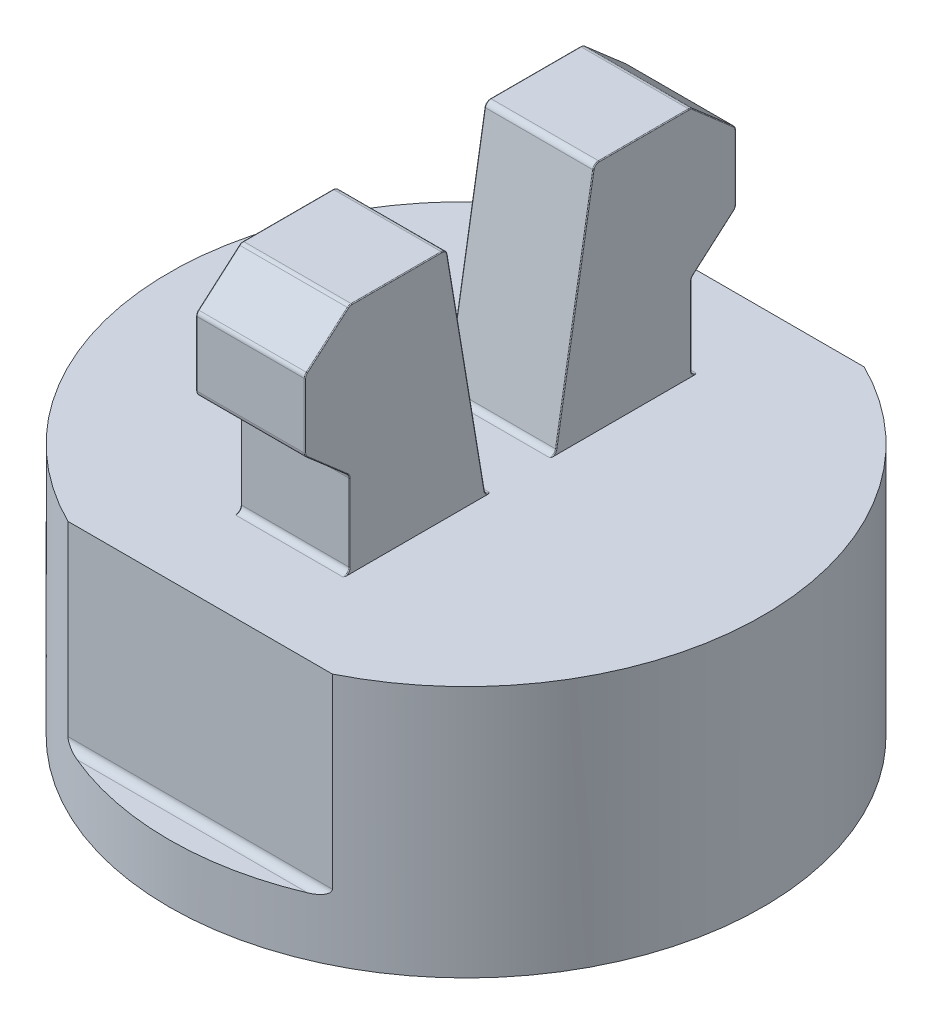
ISO-10303-21;
HEADER;
FILE_DESCRIPTION(('STEP AP214'),'2;1');
FILE_NAME('part.step','',(''),(''),'','','');
FILE_SCHEMA(('AUTOMOTIVE_DESIGN { 1 0 10303 214 1 1 1 1 }'));
ENDSEC;
DATA;
#1=APPLICATION_CONTEXT('core data for automotive mechanical design processes');
#2=APPLICATION_PROTOCOL_DEFINITION('international standard','automotive_design',2000,#1);
#3=PRODUCT_CONTEXT('',#1,'mechanical');
#4=PRODUCT('Part','Part','',(#3));
#5=PRODUCT_RELATED_PRODUCT_CATEGORY('part','',(#4));
#6=PRODUCT_DEFINITION_FORMATION('','',#4);
#7=PRODUCT_DEFINITION_CONTEXT('part definition',#1,'design');
#8=PRODUCT_DEFINITION('design','',#6,#7);
#9=PRODUCT_DEFINITION_SHAPE('','',#8);
#10=(LENGTH_UNIT() NAMED_UNIT(*) SI_UNIT(.MILLI.,.METRE.));
#11=(NAMED_UNIT(*) PLANE_ANGLE_UNIT() SI_UNIT($,.RADIAN.));
#12=(NAMED_UNIT(*) SI_UNIT($,.STERADIAN.) SOLID_ANGLE_UNIT());
#13=UNCERTAINTY_MEASURE_WITH_UNIT(LENGTH_MEASURE(1.E-05),#10,'distance_accuracy_value','');
#14=(GEOMETRIC_REPRESENTATION_CONTEXT(3) GLOBAL_UNCERTAINTY_ASSIGNED_CONTEXT((#13)) GLOBAL_UNIT_ASSIGNED_CONTEXT((#10,
#11,#12)) REPRESENTATION_CONTEXT('',''));
#15=CARTESIAN_POINT('',(0.,0.,0.));
#16=DIRECTION('',(0.,0.,1.));
#17=DIRECTION('',(1.,0.,0.));
#18=AXIS2_PLACEMENT_3D('',#15,#16,#17);
#19=CARTESIAN_POINT('',(0.,6.5,0.));
#20=DIRECTION('',(0.,1.,0.));
#21=DIRECTION('',(0.,0.,1.));
#22=AXIS2_PLACEMENT_3D('',#19,#20,#21);
#23=PLANE('',#22);
#24=DIRECTION('',(1.,0.,0.));
#25=VECTOR('',#24,1.);
#26=CARTESIAN_POINT('',(0.,6.5,-6.85));
#27=LINE('',#26,#25);
#28=CARTESIAN_POINT('',(-3.40587727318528,6.5,-6.85));
#29=VERTEX_POINT('',#28);
#30=CARTESIAN_POINT('',(3.40587727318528,6.5,-6.85));
#31=VERTEX_POINT('',#30);
#32=EDGE_CURVE('E527',#29,#31,#27,.T.);
#33=ORIENTED_EDGE('',*,*,#32,.F.);
#34=CARTESIAN_POINT('',(0.,6.5,0.));
#35=DIRECTION('',(0.,1.,0.));
#36=DIRECTION('',(0.,0.,1.));
#37=AXIS2_PLACEMENT_3D('',#34,#35,#36);
#38=CIRCLE('',#37,7.65);
#39=CARTESIAN_POINT('',(-3.40587727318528,6.5,6.85));
#40=VERTEX_POINT('',#39);
#41=EDGE_CURVE('E541',#29,#40,#38,.T.);
#42=ORIENTED_EDGE('',*,*,#41,.T.);
#43=DIRECTION('',(1.,0.,0.));
#44=VECTOR('',#43,1.);
#45=CARTESIAN_POINT('',(0.,6.5,6.85));
#46=LINE('',#45,#44);
#47=CARTESIAN_POINT('',(3.40587727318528,6.5,6.85));
#48=VERTEX_POINT('',#47);
#49=EDGE_CURVE('E1645',#40,#48,#46,.T.);
#50=ORIENTED_EDGE('',*,*,#49,.T.);
#51=EDGE_CURVE('E543',#48,#31,#38,.T.);
#52=ORIENTED_EDGE('',*,*,#51,.T.);
#53=EDGE_LOOP('',(#33,#42,#50,#52));
#54=FACE_BOUND('',#53,.T.);
#55=DIRECTION('',(1.,0.,0.));
#56=VECTOR('',#55,1.);
#57=CARTESIAN_POINT('',(1.4,6.5,-4.55));
#58=LINE('',#57,#56);
#59=CARTESIAN_POINT('',(-1.38,6.5,-4.55));
#60=VERTEX_POINT('',#59);
#61=CARTESIAN_POINT('',(1.38,6.5,-4.55));
#62=VERTEX_POINT('',#61);
#63=EDGE_CURVE('E1537',#60,#62,#58,.T.);
#64=ORIENTED_EDGE('',*,*,#63,.T.);
#65=CARTESIAN_POINT('',(1.4,6.5,-4.47));
#66=CARTESIAN_POINT('',(1.39995585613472,6.5,-4.47663371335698));
#67=CARTESIAN_POINT('',(1.39928345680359,6.5,-4.48320248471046));
#68=CARTESIAN_POINT('',(1.39708711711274,6.5,-4.49614878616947));
#69=CARTESIAN_POINT('',(1.3955702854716,6.5,-4.50252745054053));
#70=CARTESIAN_POINT('',(1.3901750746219,6.5,-4.52200630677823));
#71=CARTESIAN_POINT('',(1.38552306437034,6.5,-4.53486734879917));
#72=CARTESIAN_POINT('',(1.38056003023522,6.5,-4.54846610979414));
#73=CARTESIAN_POINT('',(1.38027996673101,6.5,-4.54923307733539));
#74=CARTESIAN_POINT('',(1.38,6.5,-4.55));
#75=B_SPLINE_CURVE_WITH_KNOTS('',3,(#65,#66,#67,#68,#69,#70,#71,#72,#73,#74),.UNSPECIFIED.,.F.,
.F.,(4,2,2,2,4),(0.,0.0197864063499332,0.0394087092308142,0.0803840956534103,
0.0828335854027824),.UNSPECIFIED.);
#76=CARTESIAN_POINT('',(1.4,6.5,-4.47));
#77=VERTEX_POINT('',#76);
#78=EDGE_CURVE('E1199',#62,#77,#75,.F.);
#79=ORIENTED_EDGE('',*,*,#78,.T.);
#80=DIRECTION('',(0.,0.,1.));
#81=VECTOR('',#80,1.);
#82=CARTESIAN_POINT('',(1.4,6.5,-4.4));
#83=LINE('',#82,#81);
#84=CARTESIAN_POINT('',(1.4,6.5,-0.852930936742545));
#85=VERTEX_POINT('',#84);
#86=EDGE_CURVE('E573',#77,#85,#83,.T.);
#87=ORIENTED_EDGE('',*,*,#86,.T.);
#88=CARTESIAN_POINT('',(1.4,6.5,-0.852930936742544));
#89=CARTESIAN_POINT('',(1.39995585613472,6.5,-0.846297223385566));
#90=CARTESIAN_POINT('',(1.39928345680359,6.5,-0.839728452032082));
#91=CARTESIAN_POINT('',(1.39708711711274,6.5,-0.826782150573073));
#92=CARTESIAN_POINT('',(1.3955702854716,6.5,-0.820403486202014));
#93=CARTESIAN_POINT('',(1.3901750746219,6.5,-0.800924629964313));
#94=CARTESIAN_POINT('',(1.38552306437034,6.5,-0.788063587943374));
#95=CARTESIAN_POINT('',(1.38056003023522,6.5,-0.774464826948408));
#96=CARTESIAN_POINT('',(1.38027996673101,6.5,-0.77369785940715));
#97=CARTESIAN_POINT('',(1.38,6.5,-0.772930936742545));
#98=B_SPLINE_CURVE_WITH_KNOTS('',3,(#88,#89,#90,#91,#92,#93,#94,#95,#96,#97),.UNSPECIFIED.,.F.,
.F.,(4,2,2,2,4),(0.,0.0197864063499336,0.039408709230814,0.0803840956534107,0.0828335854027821),.UNSPECIFIED.);
#99=CARTESIAN_POINT('',(1.38,6.5,-0.772930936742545));
#100=VERTEX_POINT('',#99);
#101=EDGE_CURVE('E1191',#85,#100,#98,.T.);
#102=ORIENTED_EDGE('',*,*,#101,.T.);
#103=DIRECTION('',(1.,0.,0.));
#104=VECTOR('',#103,1.);
#105=CARTESIAN_POINT('',(0.,6.5,-0.772930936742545));
#106=LINE('',#105,#104);
#107=CARTESIAN_POINT('',(-1.38,6.5,-0.772930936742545));
#108=VERTEX_POINT('',#107);
#109=EDGE_CURVE('E1533',#100,#108,#106,.F.);
#110=ORIENTED_EDGE('',*,*,#109,.T.);
#111=CARTESIAN_POINT('',(-1.4,6.5,-0.852930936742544));
#112=CARTESIAN_POINT('',(-1.39995585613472,6.5,-0.846297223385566));
#113=CARTESIAN_POINT('',(-1.39928345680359,6.5,-0.839728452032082));
#114=CARTESIAN_POINT('',(-1.39708711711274,6.5,-0.826782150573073));
#115=CARTESIAN_POINT('',(-1.3955702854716,6.5,-0.820403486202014));
#116=CARTESIAN_POINT('',(-1.3901750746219,6.5,-0.800924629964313));
#117=CARTESIAN_POINT('',(-1.38552306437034,6.5,-0.788063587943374));
#118=CARTESIAN_POINT('',(-1.38056003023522,6.5,-0.774464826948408));
#119=CARTESIAN_POINT('',(-1.38027996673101,6.5,-0.77369785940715));
#120=CARTESIAN_POINT('',(-1.38,6.5,-0.772930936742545));
#121=B_SPLINE_CURVE_WITH_KNOTS('',3,(#111,#112,#113,#114,#115,#116,#117,#118,#119,#120),
.UNSPECIFIED.,.F.,.F.,(4,2,2,2,4),(0.,0.0197864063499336,0.039408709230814,0.0803840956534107,
0.0828335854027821),.UNSPECIFIED.);
#122=CARTESIAN_POINT('',(-1.4,6.5,-0.852930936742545));
#123=VERTEX_POINT('',#122);
#124=EDGE_CURVE('E1183',#108,#123,#121,.F.);
#125=ORIENTED_EDGE('',*,*,#124,.T.);
#126=DIRECTION('',(0.,0.,1.));
#127=VECTOR('',#126,1.);
#128=CARTESIAN_POINT('',(-1.4,6.5,-4.4));
#129=LINE('',#128,#127);
#130=CARTESIAN_POINT('',(-1.4,6.5,-4.47));
#131=VERTEX_POINT('',#130);
#132=EDGE_CURVE('E559',#131,#123,#129,.T.);
#133=ORIENTED_EDGE('',*,*,#132,.F.);
#134=CARTESIAN_POINT('',(-1.4,6.5,-4.47));
#135=CARTESIAN_POINT('',(-1.39995585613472,6.5,-4.47663371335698));
#136=CARTESIAN_POINT('',(-1.39928345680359,6.5,-4.48320248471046));
#137=CARTESIAN_POINT('',(-1.39708711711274,6.5,-4.49614878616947));
#138=CARTESIAN_POINT('',(-1.3955702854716,6.5,-4.50252745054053));
#139=CARTESIAN_POINT('',(-1.3901750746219,6.5,-4.52200630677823));
#140=CARTESIAN_POINT('',(-1.38552306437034,6.5,-4.53486734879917));
#141=CARTESIAN_POINT('',(-1.38056003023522,6.5,-4.54846610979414));
#142=CARTESIAN_POINT('',(-1.38027996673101,6.5,-4.54923307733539));
#143=CARTESIAN_POINT('',(-1.38,6.5,-4.55));
#144=B_SPLINE_CURVE_WITH_KNOTS('',3,(#134,#135,#136,#137,#138,#139,#140,#141,#142,#143),
.UNSPECIFIED.,.F.,.F.,(4,2,2,2,4),(0.,0.0197864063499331,0.0394087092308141,0.0803840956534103,
0.0828335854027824),.UNSPECIFIED.);
#145=EDGE_CURVE('E1173',#131,#60,#144,.T.);
#146=ORIENTED_EDGE('',*,*,#145,.T.);
#147=EDGE_LOOP('',(#64,#79,#87,#102,#110,#125,#133,#146));
#148=FACE_BOUND('',#147,.T.);
#149=DIRECTION('',(0.,0.,1.));
#150=VECTOR('',#149,1.);
#151=CARTESIAN_POINT('',(-1.4,6.5,0.));
#152=LINE('',#151,#150);
#153=CARTESIAN_POINT('',(-1.4,6.5,4.47));
#154=VERTEX_POINT('',#153);
#155=CARTESIAN_POINT('',(-1.4,6.5,0.852930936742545));
#156=VERTEX_POINT('',#155);
#157=EDGE_CURVE('E659',#154,#156,#152,.F.);
#158=ORIENTED_EDGE('',*,*,#157,.T.);
#159=CARTESIAN_POINT('',(-1.4,6.5,0.852930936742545));
#160=CARTESIAN_POINT('',(-1.39995585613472,6.5,0.846297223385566));
#161=CARTESIAN_POINT('',(-1.39928345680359,6.5,0.839728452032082));
#162=CARTESIAN_POINT('',(-1.39708711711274,6.5,0.826782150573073));
#163=CARTESIAN_POINT('',(-1.3955702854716,6.5,0.820403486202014));
#164=CARTESIAN_POINT('',(-1.3901750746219,6.5,0.800924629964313));
#165=CARTESIAN_POINT('',(-1.38552306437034,6.5,0.788063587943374));
#166=CARTESIAN_POINT('',(-1.38056003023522,6.5,0.774464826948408));
#167=CARTESIAN_POINT('',(-1.38027996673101,6.5,0.77369785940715));
#168=CARTESIAN_POINT('',(-1.38,6.5,0.772930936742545));
#169=B_SPLINE_CURVE_WITH_KNOTS('',3,(#159,#160,#161,#162,#163,#164,#165,#166,#167,#168),
.UNSPECIFIED.,.F.,.F.,(4,2,2,2,4),(0.,0.0197864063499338,0.0394087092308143,0.080384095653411,
0.0828335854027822),.UNSPECIFIED.);
#170=CARTESIAN_POINT('',(-1.38,6.5,0.772930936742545));
#171=VERTEX_POINT('',#170);
#172=EDGE_CURVE('E1213',#156,#171,#169,.T.);
#173=ORIENTED_EDGE('',*,*,#172,.T.);
#174=DIRECTION('',(1.,0.,0.));
#175=VECTOR('',#174,1.);
#176=CARTESIAN_POINT('',(0.,6.5,0.772930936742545));
#177=LINE('',#176,#175);
#178=CARTESIAN_POINT('',(1.38,6.5,0.772930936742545));
#179=VERTEX_POINT('',#178);
#180=EDGE_CURVE('E733',#171,#179,#177,.T.);
#181=ORIENTED_EDGE('',*,*,#180,.T.);
#182=CARTESIAN_POINT('',(1.4,6.5,0.852930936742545));
#183=CARTESIAN_POINT('',(1.39995585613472,6.5,0.846297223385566));
#184=CARTESIAN_POINT('',(1.39928345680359,6.5,0.839728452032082));
#185=CARTESIAN_POINT('',(1.39708711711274,6.5,0.826782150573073));
#186=CARTESIAN_POINT('',(1.3955702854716,6.5,0.820403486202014));
#187=CARTESIAN_POINT('',(1.3901750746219,6.5,0.800924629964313));
#188=CARTESIAN_POINT('',(1.38552306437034,6.5,0.788063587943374));
#189=CARTESIAN_POINT('',(1.38056003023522,6.5,0.774464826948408));
#190=CARTESIAN_POINT('',(1.38027996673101,6.5,0.77369785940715));
#191=CARTESIAN_POINT('',(1.38,6.5,0.772930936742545));
#192=B_SPLINE_CURVE_WITH_KNOTS('',3,(#182,#183,#184,#185,#186,#187,#188,#189,#190,#191),
.UNSPECIFIED.,.F.,.F.,(4,2,2,2,4),(0.,0.0197864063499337,0.0394087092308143,0.080384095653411,
0.0828335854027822),.UNSPECIFIED.);
#193=CARTESIAN_POINT('',(1.4,6.5,0.852930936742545));
#194=VERTEX_POINT('',#193);
#195=EDGE_CURVE('E1156',#179,#194,#192,.F.);
#196=ORIENTED_EDGE('',*,*,#195,.T.);
#197=DIRECTION('',(0.,0.,1.));
#198=VECTOR('',#197,1.);
#199=CARTESIAN_POINT('',(1.4,6.5,0.));
#200=LINE('',#199,#198);
#201=CARTESIAN_POINT('',(1.4,6.5,4.47));
#202=VERTEX_POINT('',#201);
#203=EDGE_CURVE('E655',#202,#194,#200,.F.);
#204=ORIENTED_EDGE('',*,*,#203,.F.);
#205=CARTESIAN_POINT('',(1.4,6.5,4.47));
#206=CARTESIAN_POINT('',(1.39995585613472,6.5,4.47663371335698));
#207=CARTESIAN_POINT('',(1.39928345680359,6.5,4.48320248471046));
#208=CARTESIAN_POINT('',(1.39708711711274,6.5,4.49614878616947));
#209=CARTESIAN_POINT('',(1.3955702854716,6.5,4.50252745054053));
#210=CARTESIAN_POINT('',(1.3901750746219,6.5,4.52200630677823));
#211=CARTESIAN_POINT('',(1.38552306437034,6.5,4.53486734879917));
#212=CARTESIAN_POINT('',(1.38056003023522,6.5,4.54846610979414));
#213=CARTESIAN_POINT('',(1.38027996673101,6.5,4.54923307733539));
#214=CARTESIAN_POINT('',(1.38,6.5,4.55));
#215=B_SPLINE_CURVE_WITH_KNOTS('',3,(#205,#206,#207,#208,#209,#210,#211,#212,#213,#214),
.UNSPECIFIED.,.F.,.F.,(4,2,2,2,4),(0.,0.0197864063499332,0.0394087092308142,0.0803840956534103,
0.0828335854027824),.UNSPECIFIED.);
#216=CARTESIAN_POINT('',(1.38,6.5,4.55));
#217=VERTEX_POINT('',#216);
#218=EDGE_CURVE('E1108',#202,#217,#215,.T.);
#219=ORIENTED_EDGE('',*,*,#218,.T.);
#220=DIRECTION('',(1.,0.,0.));
#221=VECTOR('',#220,1.);
#222=CARTESIAN_POINT('',(-1.4,6.5,4.55));
#223=LINE('',#222,#221);
#224=CARTESIAN_POINT('',(-1.38,6.5,4.55));
#225=VERTEX_POINT('',#224);
#226=EDGE_CURVE('E736',#217,#225,#223,.F.);
#227=ORIENTED_EDGE('',*,*,#226,.T.);
#228=CARTESIAN_POINT('',(-1.4,6.5,4.47));
#229=CARTESIAN_POINT('',(-1.39995585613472,6.5,4.47663371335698));
#230=CARTESIAN_POINT('',(-1.39928345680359,6.5,4.48320248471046));
#231=CARTESIAN_POINT('',(-1.39708711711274,6.5,4.49614878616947));
#232=CARTESIAN_POINT('',(-1.3955702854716,6.5,4.50252745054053));
#233=CARTESIAN_POINT('',(-1.3901750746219,6.5,4.52200630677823));
#234=CARTESIAN_POINT('',(-1.38552306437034,6.5,4.53486734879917));
#235=CARTESIAN_POINT('',(-1.38056003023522,6.5,4.54846610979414));
#236=CARTESIAN_POINT('',(-1.38027996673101,6.5,4.54923307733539));
#237=CARTESIAN_POINT('',(-1.38,6.5,4.55));
#238=B_SPLINE_CURVE_WITH_KNOTS('',3,(#228,#229,#230,#231,#232,#233,#234,#235,#236,#237),
.UNSPECIFIED.,.F.,.F.,(4,2,2,2,4),(0.,0.0197864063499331,0.0394087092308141,0.0803840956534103,
0.0828335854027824),.UNSPECIFIED.);
#239=EDGE_CURVE('E1207',#225,#154,#238,.F.);
#240=ORIENTED_EDGE('',*,*,#239,.T.);
#241=EDGE_LOOP('',(#158,#173,#181,#196,#204,#219,#227,#240));
#242=FACE_BOUND('',#241,.T.);
#243=ADVANCED_FACE('F129',(#54,#148,#242),#23,.T.);
#244=CARTESIAN_POINT('',(0.,6.5,0.));
#245=DIRECTION('',(0.,-1.,0.));
#246=DIRECTION('',(0.,0.,-1.));
#247=AXIS2_PLACEMENT_3D('',#244,#245,#246);
#248=CYLINDRICAL_SURFACE('',#247,7.65);
#249=ORIENTED_EDGE('',*,*,#41,.F.);
#250=DIRECTION('',(0.,1.,0.));
#251=VECTOR('',#250,1.);
#252=CARTESIAN_POINT('',(-3.40587727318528,1.5,-6.85));
#253=LINE('',#252,#251);
#254=CARTESIAN_POINT('',(-3.40587727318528,1.7,-6.85));
#255=VERTEX_POINT('',#254);
#256=EDGE_CURVE('E523',#255,#29,#253,.T.);
#257=ORIENTED_EDGE('',*,*,#256,.F.);
#258=CARTESIAN_POINT('',(-3.40587727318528,1.7,-6.85));
#259=CARTESIAN_POINT('',(-3.40588992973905,1.69453266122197,-6.84999352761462));
#260=CARTESIAN_POINT('',(-3.40542703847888,1.68908373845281,-6.8502238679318));
#261=CARTESIAN_POINT('',(-3.40366707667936,1.67841636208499,-6.85109859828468));
#262=CARTESIAN_POINT('',(-3.40237932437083,1.67319602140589,-6.85173836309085));
#263=CARTESIAN_POINT('',(-3.39869257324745,1.6618540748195,-6.85356794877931));
#264=CARTESIAN_POINT('',(-3.39610293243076,1.65581086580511,-6.85485200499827));
#265=CARTESIAN_POINT('',(-3.39007914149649,1.64425327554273,-6.85783310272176));
#266=CARTESIAN_POINT('',(-3.38664115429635,1.63874145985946,-6.85953202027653));
#267=CARTESIAN_POINT('',(-3.37697855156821,1.62522470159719,-6.86429593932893));
#268=CARTESIAN_POINT('',(-3.37029478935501,1.61762973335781,-6.86758147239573));
#269=CARTESIAN_POINT('',(-3.3559995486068,1.60362292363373,-6.87457863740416));
#270=CARTESIAN_POINT('',(-3.348386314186,1.59721338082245,-6.87829107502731));
#271=CARTESIAN_POINT('',(-3.32508762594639,1.579740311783,-6.88959951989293));
#272=CARTESIAN_POINT('',(-3.30858135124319,1.57001282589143,-6.8975459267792));
#273=CARTESIAN_POINT('',(-3.27443287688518,1.55305335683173,-6.91382343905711));
#274=CARTESIAN_POINT('',(-3.25678342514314,1.54583963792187,-6.92215688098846));
#275=CARTESIAN_POINT('',(-3.21695152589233,1.53197689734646,-6.94077116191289));
#276=CARTESIAN_POINT('',(-3.19462111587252,1.52579551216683,-6.95107971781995));
#277=CARTESIAN_POINT('',(-3.14942117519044,1.51561772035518,-6.97167602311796));
#278=CARTESIAN_POINT('',(-3.12655054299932,1.5116262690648,-6.98196367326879));
#279=CARTESIAN_POINT('',(-3.08140185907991,1.505572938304,-7.00200314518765));
#280=CARTESIAN_POINT('',(-3.0591350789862,1.50344242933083,-7.01176030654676));
#281=CARTESIAN_POINT('',(-3.01453915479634,1.50066718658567,-7.03104857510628));
#282=CARTESIAN_POINT('',(-2.99221084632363,1.50001524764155,-7.04058055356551));
#283=CARTESIAN_POINT('',(-2.96984848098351,1.5,-7.05));
#284=B_SPLINE_CURVE_WITH_KNOTS('',3,(#258,#259,#260,#261,#262,#263,#264,#265,#266,#267,#268,
#269,#270,#271,#272,#273,#274,#275,#276,#277,#278,#279,#280,#281,#282,#283),.UNSPECIFIED.,.F.,
.F.,(4,2,2,2,2,2,2,2,2,2,2,2,4),(0.,0.0163478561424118,0.032514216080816,0.0524993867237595,
0.0725766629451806,0.10430808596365,0.13610040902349,0.197979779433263,0.260299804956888,
0.336234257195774,0.412339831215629,0.485503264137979,0.558309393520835),.UNSPECIFIED.);
#285=CARTESIAN_POINT('',(-2.96984848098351,1.5,-7.05));
#286=VERTEX_POINT('',#285);
#287=EDGE_CURVE('E1124',#255,#286,#284,.T.);
#288=ORIENTED_EDGE('',*,*,#287,.T.);
#289=CARTESIAN_POINT('',(0.,1.5,0.));
#290=DIRECTION('',(0.,1.,0.));
#291=DIRECTION('',(0.,0.,1.));
#292=AXIS2_PLACEMENT_3D('',#289,#290,#291);
#293=CIRCLE('',#292,7.65);
#294=CARTESIAN_POINT('',(2.96984848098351,1.5,-7.05));
#295=VERTEX_POINT('',#294);
#296=EDGE_CURVE('E535',#295,#286,#293,.T.);
#297=ORIENTED_EDGE('',*,*,#296,.F.);
#298=CARTESIAN_POINT('',(2.96984848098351,1.5,-7.05));
#299=CARTESIAN_POINT('',(2.9908705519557,1.50001174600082,-7.04114496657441));
#300=CARTESIAN_POINT('',(3.0118613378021,1.50058940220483,-7.03219117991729));
#301=CARTESIAN_POINT('',(3.0537654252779,1.50303338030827,-7.01409558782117));
#302=CARTESIAN_POINT('',(3.07467825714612,1.5049038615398,-7.00495326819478));
#303=CARTESIAN_POINT('',(3.11614290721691,1.51007583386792,-6.98660609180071));
#304=CARTESIAN_POINT('',(3.13669617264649,1.51336819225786,-6.97740199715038));
#305=CARTESIAN_POINT('',(3.17741866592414,1.52163882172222,-6.9589516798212));
#306=CARTESIAN_POINT('',(3.19758841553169,1.52661459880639,-6.94970553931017));
#307=CARTESIAN_POINT('',(3.22977088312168,1.53637783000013,-6.93478657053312));
#308=CARTESIAN_POINT('',(3.24196940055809,1.54051766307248,-6.92909168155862));
#309=CARTESIAN_POINT('',(3.26610466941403,1.54978909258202,-6.91774809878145));
#310=CARTESIAN_POINT('',(3.27803962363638,1.55492599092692,-6.91209982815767));
#311=CARTESIAN_POINT('',(3.30519495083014,1.56823592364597,-6.89916513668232));
#312=CARTESIAN_POINT('',(3.32022973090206,1.57685359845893,-6.89193960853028));
#313=CARTESIAN_POINT('',(3.34862848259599,1.59691160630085,-6.87818494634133));
#314=CARTESIAN_POINT('',(3.36200658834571,1.60832516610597,-6.87165000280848));
#315=CARTESIAN_POINT('',(3.37764053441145,1.62639462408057,-6.86396870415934));
#316=CARTESIAN_POINT('',(3.38148499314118,1.63133912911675,-6.86207513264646));
#317=CARTESIAN_POINT('',(3.38855483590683,1.64176507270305,-6.85858668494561));
#318=CARTESIAN_POINT('',(3.39177978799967,1.64724688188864,-6.85699201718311));
#319=CARTESIAN_POINT('',(3.39742880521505,1.65881488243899,-6.85419490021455));
#320=CARTESIAN_POINT('',(3.39984072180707,1.66490861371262,-6.85299840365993));
#321=CARTESIAN_POINT('',(3.40352659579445,1.67750458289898,-6.85116859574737));
#322=CARTESIAN_POINT('',(3.40480532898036,1.68400498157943,-6.85053292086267));
#323=CARTESIAN_POINT('',(3.40557884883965,1.69213606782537,-6.85014837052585));
#324=CARTESIAN_POINT('',(3.40569062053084,1.69370632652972,-6.85009280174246));
#325=CARTESIAN_POINT('',(3.40583971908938,1.69685080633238,-6.85001867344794));
#326=CARTESIAN_POINT('',(3.4058770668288,1.69842502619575,-6.85000010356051));
#327=CARTESIAN_POINT('',(3.40587727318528,1.7,-6.85));
#328=B_SPLINE_CURVE_WITH_KNOTS('',3,(#298,#299,#300,#301,#302,#303,#304,#305,#306,#307,#308,
#309,#310,#311,#312,#313,#314,#315,#316,#317,#318,#319,#320,#321,#322,#323,#324,#325,#326,#327),
.UNSPECIFIED.,.F.,.F.,(4,2,2,2,2,2,2,2,2,2,2,2,2,2,4),(0.,0.0684404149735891,0.137102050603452,
0.205329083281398,0.273455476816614,0.315680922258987,0.358137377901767,0.414322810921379,
0.469989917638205,0.489574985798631,0.509173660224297,0.529053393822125,0.548848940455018,
0.553573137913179,0.558296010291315),.UNSPECIFIED.);
#329=CARTESIAN_POINT('',(3.40587727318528,1.7,-6.85));
#330=VERTEX_POINT('',#329);
#331=EDGE_CURVE('E1117',#295,#330,#328,.T.);
#332=ORIENTED_EDGE('',*,*,#331,.T.);
#333=DIRECTION('',(0.,1.,0.));
#334=VECTOR('',#333,1.);
#335=CARTESIAN_POINT('',(3.40587727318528,1.5,-6.85));
#336=LINE('',#335,#334);
#337=EDGE_CURVE('E534',#330,#31,#336,.T.);
#338=ORIENTED_EDGE('',*,*,#337,.T.);
#339=ORIENTED_EDGE('',*,*,#51,.F.);
#340=DIRECTION('',(0.,1.,0.));
#341=VECTOR('',#340,1.);
#342=CARTESIAN_POINT('',(3.40587727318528,1.5,6.85));
#343=LINE('',#342,#341);
#344=CARTESIAN_POINT('',(3.40587727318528,1.7,6.85));
#345=VERTEX_POINT('',#344);
#346=EDGE_CURVE('E545',#345,#48,#343,.T.);
#347=ORIENTED_EDGE('',*,*,#346,.F.);
#348=CARTESIAN_POINT('',(3.40587727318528,1.7,6.85));
#349=CARTESIAN_POINT('',(3.40588992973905,1.69453266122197,6.84999352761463));
#350=CARTESIAN_POINT('',(3.40542703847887,1.68908373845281,6.8502238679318));
#351=CARTESIAN_POINT('',(3.40366707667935,1.67841636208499,6.85109859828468));
#352=CARTESIAN_POINT('',(3.40237932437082,1.6731960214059,6.85173836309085));
#353=CARTESIAN_POINT('',(3.39869257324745,1.6618540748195,6.85356794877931));
#354=CARTESIAN_POINT('',(3.39610293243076,1.65581086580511,6.85485200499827));
#355=CARTESIAN_POINT('',(3.39007914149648,1.64425327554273,6.85783310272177));
#356=CARTESIAN_POINT('',(3.38664115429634,1.63874145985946,6.85953202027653));
#357=CARTESIAN_POINT('',(3.37697855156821,1.62522470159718,6.86429593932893));
#358=CARTESIAN_POINT('',(3.37029478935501,1.61762973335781,6.86758147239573));
#359=CARTESIAN_POINT('',(3.35599954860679,1.60362292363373,6.87457863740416));
#360=CARTESIAN_POINT('',(3.348386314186,1.59721338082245,6.87829107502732));
#361=CARTESIAN_POINT('',(3.32508762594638,1.579740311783,6.88959951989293));
#362=CARTESIAN_POINT('',(3.30858135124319,1.57001282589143,6.89754592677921));
#363=CARTESIAN_POINT('',(3.27443287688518,1.55305335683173,6.91382343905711));
#364=CARTESIAN_POINT('',(3.25678342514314,1.54583963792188,6.92215688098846));
#365=CARTESIAN_POINT('',(3.21695152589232,1.53197689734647,6.94077116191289));
#366=CARTESIAN_POINT('',(3.19462111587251,1.52579551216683,6.95107971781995));
#367=CARTESIAN_POINT('',(3.14942117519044,1.51561772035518,6.97167602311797));
#368=CARTESIAN_POINT('',(3.12655054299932,1.5116262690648,6.98196367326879));
#369=CARTESIAN_POINT('',(3.08140185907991,1.50557293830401,7.00200314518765));
#370=CARTESIAN_POINT('',(3.0591350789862,1.50344242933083,7.01176030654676));
#371=CARTESIAN_POINT('',(3.01453915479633,1.50066718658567,7.03104857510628));
#372=CARTESIAN_POINT('',(2.99221084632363,1.50001524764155,7.04058055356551));
#373=CARTESIAN_POINT('',(2.9698484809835,1.5,7.05));
#374=B_SPLINE_CURVE_WITH_KNOTS('',3,(#348,#349,#350,#351,#352,#353,#354,#355,#356,#357,#358,
#359,#360,#361,#362,#363,#364,#365,#366,#367,#368,#369,#370,#371,#372,#373),.UNSPECIFIED.,.F.,
.F.,(4,2,2,2,2,2,2,2,2,2,2,2,4),(0.,0.0163478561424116,0.032514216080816,0.0524993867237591,
0.0725766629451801,0.104308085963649,0.136100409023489,0.197979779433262,0.260299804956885,
0.336234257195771,0.412339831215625,0.485503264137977,0.558309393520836),.UNSPECIFIED.);
#375=CARTESIAN_POINT('',(2.9698484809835,1.5,7.05));
#376=VERTEX_POINT('',#375);
#377=EDGE_CURVE('E144',#345,#376,#374,.T.);
#378=ORIENTED_EDGE('',*,*,#377,.T.);
#379=CARTESIAN_POINT('',(0.,1.5,0.));
#380=DIRECTION('',(0.,1.,0.));
#381=DIRECTION('',(0.,0.,1.));
#382=AXIS2_PLACEMENT_3D('',#379,#380,#381);
#383=CIRCLE('',#382,7.65);
#384=CARTESIAN_POINT('',(-2.9698484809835,1.5,7.05));
#385=VERTEX_POINT('',#384);
#386=EDGE_CURVE('E2568',#385,#376,#383,.T.);
#387=ORIENTED_EDGE('',*,*,#386,.F.);
#388=CARTESIAN_POINT('',(-2.9698484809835,1.5,7.05));
#389=CARTESIAN_POINT('',(-2.9908705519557,1.50001174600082,7.04114496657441));
#390=CARTESIAN_POINT('',(-3.01186133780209,1.50058940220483,7.03219117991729));
#391=CARTESIAN_POINT('',(-3.0537654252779,1.50303338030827,7.01409558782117));
#392=CARTESIAN_POINT('',(-3.07467825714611,1.5049038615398,7.00495326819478));
#393=CARTESIAN_POINT('',(-3.11614290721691,1.51007583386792,6.98660609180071));
#394=CARTESIAN_POINT('',(-3.13669617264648,1.51336819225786,6.97740199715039));
#395=CARTESIAN_POINT('',(-3.17741866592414,1.52163882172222,6.9589516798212));
#396=CARTESIAN_POINT('',(-3.19758841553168,1.52661459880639,6.94970553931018));
#397=CARTESIAN_POINT('',(-3.22977088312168,1.53637783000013,6.93478657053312));
#398=CARTESIAN_POINT('',(-3.24196940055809,1.54051766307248,6.92909168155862));
#399=CARTESIAN_POINT('',(-3.26610466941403,1.54978909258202,6.91774809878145));
#400=CARTESIAN_POINT('',(-3.27803962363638,1.55492599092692,6.91209982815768));
#401=CARTESIAN_POINT('',(-3.30519495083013,1.56823592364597,6.89916513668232));
#402=CARTESIAN_POINT('',(-3.32022973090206,1.57685359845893,6.89193960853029));
#403=CARTESIAN_POINT('',(-3.34862848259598,1.59691160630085,6.87818494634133));
#404=CARTESIAN_POINT('',(-3.36200658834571,1.60832516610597,6.87165000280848));
#405=CARTESIAN_POINT('',(-3.37764053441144,1.62639462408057,6.86396870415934));
#406=CARTESIAN_POINT('',(-3.38148499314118,1.63133912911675,6.86207513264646));
#407=CARTESIAN_POINT('',(-3.38855483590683,1.64176507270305,6.85858668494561));
#408=CARTESIAN_POINT('',(-3.39177978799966,1.64724688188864,6.85699201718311));
#409=CARTESIAN_POINT('',(-3.39742880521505,1.65881488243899,6.85419490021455));
#410=CARTESIAN_POINT('',(-3.39984072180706,1.66490861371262,6.85299840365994));
#411=CARTESIAN_POINT('',(-3.40352659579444,1.67750458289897,6.85116859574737));
#412=CARTESIAN_POINT('',(-3.40480532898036,1.68400498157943,6.85053292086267));
#413=CARTESIAN_POINT('',(-3.40557884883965,1.69213606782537,6.85014837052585));
#414=CARTESIAN_POINT('',(-3.40569062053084,1.69370632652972,6.85009280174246));
#415=CARTESIAN_POINT('',(-3.40583971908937,1.69685080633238,6.85001867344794));
#416=CARTESIAN_POINT('',(-3.4058770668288,1.69842502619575,6.85000010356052));
#417=CARTESIAN_POINT('',(-3.40587727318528,1.7,6.85));
#418=B_SPLINE_CURVE_WITH_KNOTS('',3,(#388,#389,#390,#391,#392,#393,#394,#395,#396,#397,#398,
#399,#400,#401,#402,#403,#404,#405,#406,#407,#408,#409,#410,#411,#412,#413,#414,#415,#416,#417),
.UNSPECIFIED.,.F.,.F.,(4,2,2,2,2,2,2,2,2,2,2,2,2,2,4),(0.,0.0684404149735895,0.137102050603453,
0.205329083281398,0.273455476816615,0.315680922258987,0.358137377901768,0.41432281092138,
0.469989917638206,0.489574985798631,0.509173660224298,0.529053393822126,0.548848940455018,
0.55357313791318,0.558296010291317),.UNSPECIFIED.);
#419=CARTESIAN_POINT('',(-3.40587727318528,1.7,6.85));
#420=VERTEX_POINT('',#419);
#421=EDGE_CURVE('E12',#385,#420,#418,.T.);
#422=ORIENTED_EDGE('',*,*,#421,.T.);
#423=DIRECTION('',(0.,1.,0.));
#424=VECTOR('',#423,1.);
#425=CARTESIAN_POINT('',(-3.40587727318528,1.5,6.85));
#426=LINE('',#425,#424);
#427=EDGE_CURVE('E550',#420,#40,#426,.T.);
#428=ORIENTED_EDGE('',*,*,#427,.T.);
#429=EDGE_LOOP('',(#249,#257,#288,#297,#332,#338,#339,#347,#378,#387,#422,#428));
#430=FACE_BOUND('',#429,.T.);
#431=CARTESIAN_POINT('',(0.,0.,0.));
#432=DIRECTION('',(0.,1.,0.));
#433=DIRECTION('',(0.,0.,1.));
#434=AXIS2_PLACEMENT_3D('',#431,#432,#433);
#435=CIRCLE('',#434,7.65);
#436=CARTESIAN_POINT('',(0.,0.,7.65));
#437=VERTEX_POINT('',#436);
#438=EDGE_CURVE('E553',#437,#437,#435,.T.);
#439=ORIENTED_EDGE('',*,*,#438,.T.);
#440=EDGE_LOOP('',(#439));
#441=FACE_BOUND('',#440,.T.);
#442=ADVANCED_FACE('F547',(#430,#441),#248,.T.);
#443=CARTESIAN_POINT('',(0.,0.,4.4));
#444=DIRECTION('',(0.,0.,1.));
#445=DIRECTION('',(-1.,0.,0.));
#446=AXIS2_PLACEMENT_3D('',#443,#444,#445);
#447=PLANE('',#446);
#448=DIRECTION('',(-1.,0.,0.));
#449=VECTOR('',#448,1.);
#450=CARTESIAN_POINT('',(0.,8.6316554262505,4.4));
#451=LINE('',#450,#449);
#452=CARTESIAN_POINT('',(1.38,8.6316554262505,4.4));
#453=VERTEX_POINT('',#452);
#454=CARTESIAN_POINT('',(-1.38,8.6316554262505,4.4));
#455=VERTEX_POINT('',#454);
#456=EDGE_CURVE('E729',#453,#455,#451,.T.);
#457=ORIENTED_EDGE('',*,*,#456,.T.);
#458=DIRECTION('',(0.,1.,0.));
#459=VECTOR('',#458,1.);
#460=CARTESIAN_POINT('',(-1.38,6.65,4.4));
#461=LINE('',#460,#459);
#462=CARTESIAN_POINT('',(-1.38,6.65,4.4));
#463=VERTEX_POINT('',#462);
#464=EDGE_CURVE('E792',#455,#463,#461,.F.);
#465=ORIENTED_EDGE('',*,*,#464,.T.);
#466=DIRECTION('',(1.,0.,0.));
#467=VECTOR('',#466,1.);
#468=CARTESIAN_POINT('',(1.4,6.65,4.4));
#469=LINE('',#468,#467);
#470=CARTESIAN_POINT('',(1.38,6.65,4.4));
#471=VERTEX_POINT('',#470);
#472=EDGE_CURVE('E725',#463,#471,#469,.T.);
#473=ORIENTED_EDGE('',*,*,#472,.T.);
#474=DIRECTION('',(0.,1.,0.));
#475=VECTOR('',#474,1.);
#476=CARTESIAN_POINT('',(1.38,0.,4.4));
#477=LINE('',#476,#475);
#478=EDGE_CURVE('E795',#471,#453,#477,.T.);
#479=ORIENTED_EDGE('',*,*,#478,.T.);
#480=EDGE_LOOP('',(#457,#465,#473,#479));
#481=FACE_BOUND('',#480,.T.);
#482=ADVANCED_FACE('F1423',(#481),#447,.T.);
#483=CARTESIAN_POINT('',(0.,0.,-4.4));
#484=DIRECTION('',(0.,0.,-1.));
#485=DIRECTION('',(-1.,0.,0.));
#486=AXIS2_PLACEMENT_3D('',#483,#484,#485);
#487=PLANE('',#486);
#488=DIRECTION('',(1.,0.,0.));
#489=VECTOR('',#488,1.);
#490=CARTESIAN_POINT('',(-1.4,6.65,-4.4));
#491=LINE('',#490,#489);
#492=CARTESIAN_POINT('',(1.38,6.65,-4.4));
#493=VERTEX_POINT('',#492);
#494=CARTESIAN_POINT('',(-1.38,6.65,-4.4));
#495=VERTEX_POINT('',#494);
#496=EDGE_CURVE('E978',#493,#495,#491,.F.);
#497=ORIENTED_EDGE('',*,*,#496,.T.);
#498=DIRECTION('',(0.,1.,0.));
#499=VECTOR('',#498,1.);
#500=CARTESIAN_POINT('',(-1.38,8.6316554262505,-4.4));
#501=LINE('',#500,#499);
#502=CARTESIAN_POINT('',(-1.38,8.6316554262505,-4.4));
#503=VERTEX_POINT('',#502);
#504=EDGE_CURVE('E626',#495,#503,#501,.T.);
#505=ORIENTED_EDGE('',*,*,#504,.T.);
#506=DIRECTION('',(-1.,0.,0.));
#507=VECTOR('',#506,1.);
#508=CARTESIAN_POINT('',(0.,8.6316554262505,-4.4));
#509=LINE('',#508,#507);
#510=CARTESIAN_POINT('',(1.38,8.6316554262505,-4.4));
#511=VERTEX_POINT('',#510);
#512=EDGE_CURVE('E1543',#503,#511,#509,.F.);
#513=ORIENTED_EDGE('',*,*,#512,.T.);
#514=DIRECTION('',(0.,1.,0.));
#515=VECTOR('',#514,1.);
#516=CARTESIAN_POINT('',(1.38,0.,-4.4));
#517=LINE('',#516,#515);
#518=EDGE_CURVE('E623',#511,#493,#517,.F.);
#519=ORIENTED_EDGE('',*,*,#518,.T.);
#520=EDGE_LOOP('',(#497,#505,#513,#519));
#521=FACE_BOUND('',#520,.T.);
#522=ADVANCED_FACE('F1507',(#521),#487,.T.);
#523=CARTESIAN_POINT('',(0.,0.,0.));
#524=DIRECTION('',(0.,1.,0.));
#525=DIRECTION('',(0.,0.,1.));
#526=AXIS2_PLACEMENT_3D('',#523,#524,#525);
#527=PLANE('',#526);
#528=ORIENTED_EDGE('',*,*,#438,.F.);
#529=EDGE_LOOP('',(#528));
#530=FACE_BOUND('',#529,.T.);
#531=ADVANCED_FACE('F1169',(#530),#527,.F.);
#532=CARTESIAN_POINT('',(0.,12.5,0.));
#533=DIRECTION('',(0.,-1.,0.));
#534=DIRECTION('',(0.,0.,-1.));
#535=AXIS2_PLACEMENT_3D('',#532,#533,#534);
#536=PLANE('',#535);
#537=DIRECTION('',(1.,0.,0.));
#538=VECTOR('',#537,1.);
#539=CARTESIAN_POINT('',(0.,12.5,-4.34390374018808));
#540=LINE('',#539,#538);
#541=CARTESIAN_POINT('',(1.38,12.5,-4.34390374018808));
#542=VERTEX_POINT('',#541);
#543=CARTESIAN_POINT('',(-1.38,12.5,-4.34390374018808));
#544=VERTEX_POINT('',#543);
#545=EDGE_CURVE('E557',#542,#544,#540,.F.);
#546=ORIENTED_EDGE('',*,*,#545,.T.);
#547=DIRECTION('',(0.,0.,1.));
#548=VECTOR('',#547,1.);
#549=CARTESIAN_POINT('',(-1.38,12.5,0.));
#550=LINE('',#549,#548);
#551=CARTESIAN_POINT('',(-1.38,12.5,-2.02706906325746));
#552=VERTEX_POINT('',#551);
#553=EDGE_CURVE('E909',#544,#552,#550,.T.);
#554=ORIENTED_EDGE('',*,*,#553,.T.);
#555=DIRECTION('',(1.,0.,0.));
#556=VECTOR('',#555,1.);
#557=CARTESIAN_POINT('',(0.,12.5,-2.02706906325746));
#558=LINE('',#557,#556);
#559=CARTESIAN_POINT('',(1.38,12.5,-2.02706906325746));
#560=VERTEX_POINT('',#559);
#561=EDGE_CURVE('E919',#552,#560,#558,.T.);
#562=ORIENTED_EDGE('',*,*,#561,.T.);
#563=DIRECTION('',(0.,0.,1.));
#564=VECTOR('',#563,1.);
#565=CARTESIAN_POINT('',(1.38,12.5,-4.34390374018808));
#566=LINE('',#565,#564);
#567=EDGE_CURVE('E912',#560,#542,#566,.F.);
#568=ORIENTED_EDGE('',*,*,#567,.T.);
#569=EDGE_LOOP('',(#546,#554,#562,#568));
#570=FACE_BOUND('',#569,.T.);
#571=ADVANCED_FACE('F1167',(#570),#536,.F.);
#572=CARTESIAN_POINT('',(-1.4,0.,0.));
#573=DIRECTION('',(1.,0.,0.));
#574=DIRECTION('',(0.,0.,-1.));
#575=AXIS2_PLACEMENT_3D('',#572,#573,#574);
#576=PLANE('',#575);
#577=DIRECTION('',(0.,1.,0.));
#578=VECTOR('',#577,1.);
#579=CARTESIAN_POINT('',(-1.4,6.65,-4.38));
#580=LINE('',#579,#578);
#581=CARTESIAN_POINT('',(-1.4,8.6316554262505,-4.38));
#582=VERTEX_POINT('',#581);
#583=CARTESIAN_POINT('',(-1.4,6.65,-4.38));
#584=VERTEX_POINT('',#583);
#585=EDGE_CURVE('E610',#582,#584,#580,.F.);
#586=ORIENTED_EDGE('',*,*,#585,.T.);
#587=CARTESIAN_POINT('',(-1.4,6.65,-4.55));
#588=DIRECTION('',(1.,0.,0.));
#589=DIRECTION('',(0.,0.,-1.));
#590=AXIS2_PLACEMENT_3D('',#587,#588,#589);
#591=CIRCLE('',#590,0.17);
#592=EDGE_CURVE('E613',#584,#131,#591,.T.);
#593=ORIENTED_EDGE('',*,*,#592,.T.);
#594=ORIENTED_EDGE('',*,*,#132,.T.);
#595=CARTESIAN_POINT('',(-1.4,6.65,-0.772930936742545));
#596=DIRECTION('',(1.,0.,0.));
#597=DIRECTION('',(0.,0.,-1.));
#598=AXIS2_PLACEMENT_3D('',#595,#596,#597);
#599=CIRCLE('',#598,0.17);
#600=CARTESIAN_POINT('',(-1.4,6.62205217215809,-0.940617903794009));
#601=VERTEX_POINT('',#600);
#602=EDGE_CURVE('E598',#123,#601,#599,.T.);
#603=ORIENTED_EDGE('',*,*,#602,.T.);
#604=DIRECTION('',(0.,0.986393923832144,-0.164398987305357));
#605=VECTOR('',#604,1.);
#606=CARTESIAN_POINT('',(-1.4,0.0264417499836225,0.158650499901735));
#607=LINE('',#606,#605);
#608=CARTESIAN_POINT('',(-1.4,12.3713718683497,-1.89883785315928));
#609=VERTEX_POINT('',#608);
#610=EDGE_CURVE('E595',#601,#609,#607,.T.);
#611=ORIENTED_EDGE('',*,*,#610,.T.);
#612=CARTESIAN_POINT('',(-1.4,12.35,-2.02706906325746));
#613=DIRECTION('',(1.,0.,0.));
#614=DIRECTION('',(0.,0.,-1.));
#615=AXIS2_PLACEMENT_3D('',#612,#613,#614);
#616=CIRCLE('',#615,0.13);
#617=CARTESIAN_POINT('',(-1.4,12.48,-2.02706906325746));
#618=VERTEX_POINT('',#617);
#619=EDGE_CURVE('E592',#609,#618,#616,.F.);
#620=ORIENTED_EDGE('',*,*,#619,.T.);
#621=DIRECTION('',(0.,0.,1.));
#622=VECTOR('',#621,1.);
#623=CARTESIAN_POINT('',(-1.4,12.48,0.));
#624=LINE('',#623,#622);
#625=CARTESIAN_POINT('',(-1.4,12.48,-4.34390374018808));
#626=VERTEX_POINT('',#625);
#627=EDGE_CURVE('E589',#618,#626,#624,.F.);
#628=ORIENTED_EDGE('',*,*,#627,.T.);
#629=CARTESIAN_POINT('',(-1.4,12.35,-4.34390374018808));
#630=DIRECTION('',(1.,0.,0.));
#631=DIRECTION('',(0.,0.,-1.));
#632=AXIS2_PLACEMENT_3D('',#629,#630,#631);
#633=CIRCLE('',#632,0.13);
#634=CARTESIAN_POINT('',(-1.4,12.4480987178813,-4.4292069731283));
#635=VERTEX_POINT('',#634);
#636=EDGE_CURVE('E586',#626,#635,#633,.F.);
#637=ORIENTED_EDGE('',*,*,#636,.T.);
#638=DIRECTION('',(0.,-0.656178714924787,-0.754605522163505));
#639=VECTOR('',#638,1.);
#640=CARTESIAN_POINT('',(-1.4,9.28146332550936,-8.07083767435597));
#641=LINE('',#640,#639);
#642=CARTESIAN_POINT('',(-1.4,11.5297541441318,-5.48530323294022));
#643=VERTEX_POINT('',#642);
#644=EDGE_CURVE('E583',#635,#643,#641,.T.);
#645=ORIENTED_EDGE('',*,*,#644,.T.);
#646=CARTESIAN_POINT('',(-1.4,11.4316554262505,-5.4));
#647=DIRECTION('',(1.,0.,0.));
#648=DIRECTION('',(0.,0.,-1.));
#649=AXIS2_PLACEMENT_3D('',#646,#647,#648);
#650=CIRCLE('',#649,0.13);
#651=CARTESIAN_POINT('',(-1.4,11.4316554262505,-5.53));
#652=VERTEX_POINT('',#651);
#653=EDGE_CURVE('E579',#643,#652,#650,.F.);
#654=ORIENTED_EDGE('',*,*,#653,.T.);
#655=DIRECTION('',(0.,1.,0.));
#656=VECTOR('',#655,1.);
#657=CARTESIAN_POINT('',(-1.4,9.7683445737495,-5.53));
#658=LINE('',#657,#656);
#659=CARTESIAN_POINT('',(-1.4,9.7683445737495,-5.53));
#660=VERTEX_POINT('',#659);
#661=EDGE_CURVE('E576',#652,#660,#658,.F.);
#662=ORIENTED_EDGE('',*,*,#661,.T.);
#663=CARTESIAN_POINT('',(-1.4,9.7683445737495,-5.4));
#664=DIRECTION('',(1.,0.,0.));
#665=DIRECTION('',(0.,0.,-1.));
#666=AXIS2_PLACEMENT_3D('',#663,#664,#665);
#667=CIRCLE('',#666,0.13);
#668=CARTESIAN_POINT('',(-1.4,9.67024585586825,-5.48530323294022));
#669=VERTEX_POINT('',#668);
#670=EDGE_CURVE('E601',#660,#669,#667,.F.);
#671=ORIENTED_EDGE('',*,*,#670,.T.);
#672=DIRECTION('',(0.,0.656178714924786,-0.754605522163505));
#673=VECTOR('',#672,1.);
#674=CARTESIAN_POINT('',(-1.4,2.79044194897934,2.42647125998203));
#675=LINE('',#674,#673);
#676=CARTESIAN_POINT('',(-1.4,8.7599383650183,-4.43844961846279));
#677=VERTEX_POINT('',#676);
#678=EDGE_CURVE('E604',#669,#677,#675,.F.);
#679=ORIENTED_EDGE('',*,*,#678,.T.);
#680=CARTESIAN_POINT('',(-1.4,8.6316554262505,-4.55));
#681=DIRECTION('',(1.,0.,0.));
#682=DIRECTION('',(0.,0.,-1.));
#683=AXIS2_PLACEMENT_3D('',#680,#681,#682);
#684=CIRCLE('',#683,0.17);
#685=EDGE_CURVE('E607',#677,#582,#684,.T.);
#686=ORIENTED_EDGE('',*,*,#685,.T.);
#687=EDGE_LOOP('',(#586,#593,#594,#603,#611,#620,#628,#637,#645,#654,#662,#671,#679,#686));
#688=FACE_BOUND('',#687,.T.);
#689=ADVANCED_FACE('F1502',(#688),#576,.F.);
#690=CARTESIAN_POINT('',(0.,0.0297297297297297,0.178378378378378));
#691=DIRECTION('',(0.,-0.164398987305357,-0.986393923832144));
#692=DIRECTION('',(0.,0.986393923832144,-0.164398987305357));
#693=AXIS2_PLACEMENT_3D('',#690,#691,#692);
#694=PLANE('',#693);
#695=DIRECTION('',(1.,0.,0.));
#696=VECTOR('',#695,1.);
#697=CARTESIAN_POINT('',(0.,12.3746598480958,-1.87910997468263));
#698=LINE('',#697,#696);
#699=CARTESIAN_POINT('',(1.38,12.3746598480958,-1.87910997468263));
#700=VERTEX_POINT('',#699);
#701=CARTESIAN_POINT('',(-1.38,12.3746598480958,-1.87910997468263));
#702=VERTEX_POINT('',#701);
#703=EDGE_CURVE('E1535',#700,#702,#698,.F.);
#704=ORIENTED_EDGE('',*,*,#703,.T.);
#705=DIRECTION('',(0.,0.986393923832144,-0.164398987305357));
#706=VECTOR('',#705,1.);
#707=CARTESIAN_POINT('',(-1.38,0.0297297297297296,0.178378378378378));
#708=LINE('',#707,#706);
#709=CARTESIAN_POINT('',(-1.38,6.6253401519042,-0.920890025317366));
#710=VERTEX_POINT('',#709);
#711=EDGE_CURVE('E931',#702,#710,#708,.F.);
#712=ORIENTED_EDGE('',*,*,#711,.T.);
#713=DIRECTION('',(1.,0.,0.));
#714=VECTOR('',#713,1.);
#715=CARTESIAN_POINT('',(0.,6.6253401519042,-0.920890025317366));
#716=LINE('',#715,#714);
#717=CARTESIAN_POINT('',(1.38,6.6253401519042,-0.920890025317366));
#718=VERTEX_POINT('',#717);
#719=EDGE_CURVE('E925',#710,#718,#716,.T.);
#720=ORIENTED_EDGE('',*,*,#719,.T.);
#721=DIRECTION('',(0.,0.986393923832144,-0.164398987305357));
#722=VECTOR('',#721,1.);
#723=CARTESIAN_POINT('',(1.38,12.3746598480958,-1.87910997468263));
#724=LINE('',#723,#722);
#725=EDGE_CURVE('E941',#718,#700,#724,.T.);
#726=ORIENTED_EDGE('',*,*,#725,.T.);
#727=EDGE_LOOP('',(#704,#712,#720,#726));
#728=FACE_BOUND('',#727,.T.);
#729=ADVANCED_FACE('F1505',(#728),#694,.F.);
#730=CARTESIAN_POINT('',(1.4,0.,0.));
#731=DIRECTION('',(1.,0.,0.));
#732=DIRECTION('',(0.,0.,-1.));
#733=AXIS2_PLACEMENT_3D('',#730,#731,#732);
#734=PLANE('',#733);
#735=DIRECTION('',(0.,0.986393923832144,-0.164398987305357));
#736=VECTOR('',#735,1.);
#737=CARTESIAN_POINT('',(1.4,6.62205217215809,-0.940617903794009));
#738=LINE('',#737,#736);
#739=CARTESIAN_POINT('',(1.4,12.3713718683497,-1.89883785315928));
#740=VERTEX_POINT('',#739);
#741=CARTESIAN_POINT('',(1.4,6.62205217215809,-0.940617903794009));
#742=VERTEX_POINT('',#741);
#743=EDGE_CURVE('E848',#740,#742,#738,.F.);
#744=ORIENTED_EDGE('',*,*,#743,.T.);
#745=CARTESIAN_POINT('',(1.4,6.65,-0.772930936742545));
#746=DIRECTION('',(1.,0.,0.));
#747=DIRECTION('',(0.,0.,-1.));
#748=AXIS2_PLACEMENT_3D('',#745,#746,#747);
#749=CIRCLE('',#748,0.17);
#750=EDGE_CURVE('E844',#742,#85,#749,.F.);
#751=ORIENTED_EDGE('',*,*,#750,.T.);
#752=ORIENTED_EDGE('',*,*,#86,.F.);
#753=CARTESIAN_POINT('',(1.4,6.65,-4.55));
#754=DIRECTION('',(1.,0.,0.));
#755=DIRECTION('',(0.,0.,-1.));
#756=AXIS2_PLACEMENT_3D('',#753,#754,#755);
#757=CIRCLE('',#756,0.17);
#758=CARTESIAN_POINT('',(1.4,6.65,-4.38));
#759=VERTEX_POINT('',#758);
#760=EDGE_CURVE('E866',#77,#759,#757,.F.);
#761=ORIENTED_EDGE('',*,*,#760,.T.);
#762=DIRECTION('',(0.,1.,0.));
#763=VECTOR('',#762,1.);
#764=CARTESIAN_POINT('',(1.4,0.,-4.38));
#765=LINE('',#764,#763);
#766=CARTESIAN_POINT('',(1.4,8.6316554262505,-4.38));
#767=VERTEX_POINT('',#766);
#768=EDGE_CURVE('E869',#759,#767,#765,.T.);
#769=ORIENTED_EDGE('',*,*,#768,.T.);
#770=CARTESIAN_POINT('',(1.4,8.6316554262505,-4.55));
#771=DIRECTION('',(1.,0.,0.));
#772=DIRECTION('',(0.,0.,-1.));
#773=AXIS2_PLACEMENT_3D('',#770,#771,#772);
#774=CIRCLE('',#773,0.17);
#775=CARTESIAN_POINT('',(1.4,8.7599383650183,-4.43844961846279));
#776=VERTEX_POINT('',#775);
#777=EDGE_CURVE('E872',#767,#776,#774,.F.);
#778=ORIENTED_EDGE('',*,*,#777,.T.);
#779=DIRECTION('',(0.,0.656178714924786,-0.754605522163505));
#780=VECTOR('',#779,1.);
#781=CARTESIAN_POINT('',(1.4,9.67024585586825,-5.48530323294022));
#782=LINE('',#781,#780);
#783=CARTESIAN_POINT('',(1.4,9.67024585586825,-5.48530323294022));
#784=VERTEX_POINT('',#783);
#785=EDGE_CURVE('E875',#776,#784,#782,.T.);
#786=ORIENTED_EDGE('',*,*,#785,.T.);
#787=CARTESIAN_POINT('',(1.4,9.7683445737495,-5.4));
#788=DIRECTION('',(1.,0.,0.));
#789=DIRECTION('',(0.,0.,-1.));
#790=AXIS2_PLACEMENT_3D('',#787,#788,#789);
#791=CIRCLE('',#790,0.13);
#792=CARTESIAN_POINT('',(1.4,9.7683445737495,-5.53));
#793=VERTEX_POINT('',#792);
#794=EDGE_CURVE('E878',#784,#793,#791,.T.);
#795=ORIENTED_EDGE('',*,*,#794,.T.);
#796=DIRECTION('',(0.,-1.,0.));
#797=VECTOR('',#796,1.);
#798=CARTESIAN_POINT('',(1.4,0.,-5.53));
#799=LINE('',#798,#797);
#800=CARTESIAN_POINT('',(1.4,11.4316554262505,-5.53));
#801=VERTEX_POINT('',#800);
#802=EDGE_CURVE('E881',#793,#801,#799,.F.);
#803=ORIENTED_EDGE('',*,*,#802,.T.);
#804=CARTESIAN_POINT('',(1.4,11.4316554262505,-5.4));
#805=DIRECTION('',(1.,0.,0.));
#806=DIRECTION('',(0.,0.,-1.));
#807=AXIS2_PLACEMENT_3D('',#804,#805,#806);
#808=CIRCLE('',#807,0.13);
#809=CARTESIAN_POINT('',(1.4,11.5297541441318,-5.48530323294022));
#810=VERTEX_POINT('',#809);
#811=EDGE_CURVE('E863',#801,#810,#808,.T.);
#812=ORIENTED_EDGE('',*,*,#811,.T.);
#813=DIRECTION('',(0.,-0.656178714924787,-0.754605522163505));
#814=VECTOR('',#813,1.);
#815=CARTESIAN_POINT('',(1.4,12.4480987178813,-4.4292069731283));
#816=LINE('',#815,#814);
#817=CARTESIAN_POINT('',(1.4,12.4480987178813,-4.4292069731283));
#818=VERTEX_POINT('',#817);
#819=EDGE_CURVE('E860',#810,#818,#816,.F.);
#820=ORIENTED_EDGE('',*,*,#819,.T.);
#821=CARTESIAN_POINT('',(1.4,12.35,-4.34390374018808));
#822=DIRECTION('',(1.,0.,0.));
#823=DIRECTION('',(0.,0.,-1.));
#824=AXIS2_PLACEMENT_3D('',#821,#822,#823);
#825=CIRCLE('',#824,0.13);
#826=CARTESIAN_POINT('',(1.4,12.48,-4.34390374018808));
#827=VERTEX_POINT('',#826);
#828=EDGE_CURVE('E857',#818,#827,#825,.T.);
#829=ORIENTED_EDGE('',*,*,#828,.T.);
#830=DIRECTION('',(0.,0.,1.));
#831=VECTOR('',#830,1.);
#832=CARTESIAN_POINT('',(1.4,12.48,-2.02706906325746));
#833=LINE('',#832,#831);
#834=CARTESIAN_POINT('',(1.4,12.48,-2.02706906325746));
#835=VERTEX_POINT('',#834);
#836=EDGE_CURVE('E854',#827,#835,#833,.T.);
#837=ORIENTED_EDGE('',*,*,#836,.T.);
#838=CARTESIAN_POINT('',(1.4,12.35,-2.02706906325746));
#839=DIRECTION('',(1.,0.,0.));
#840=DIRECTION('',(0.,0.,-1.));
#841=AXIS2_PLACEMENT_3D('',#838,#839,#840);
#842=CIRCLE('',#841,0.13);
#843=EDGE_CURVE('E851',#835,#740,#842,.T.);
#844=ORIENTED_EDGE('',*,*,#843,.T.);
#845=EDGE_LOOP('',(#744,#751,#752,#761,#769,#778,#786,#795,#803,#812,#820,#829,#837,#844));
#846=FACE_BOUND('',#845,.T.);
#847=ADVANCED_FACE('F1500',(#846),#734,.T.);
#848=CARTESIAN_POINT('',(0.,0.,-5.55));
#849=DIRECTION('',(0.,0.,-1.));
#850=DIRECTION('',(-1.,0.,0.));
#851=AXIS2_PLACEMENT_3D('',#848,#849,#850);
#852=PLANE('',#851);
#853=DIRECTION('',(-1.,0.,0.));
#854=VECTOR('',#853,1.);
#855=CARTESIAN_POINT('',(-1.4,9.7683445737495,-5.55));
#856=LINE('',#855,#854);
#857=CARTESIAN_POINT('',(1.38,9.7683445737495,-5.55));
#858=VERTEX_POINT('',#857);
#859=CARTESIAN_POINT('',(-1.38,9.7683445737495,-5.55));
#860=VERTEX_POINT('',#859);
#861=EDGE_CURVE('E642',#858,#860,#856,.T.);
#862=ORIENTED_EDGE('',*,*,#861,.T.);
#863=DIRECTION('',(0.,1.,0.));
#864=VECTOR('',#863,1.);
#865=CARTESIAN_POINT('',(-1.38,11.4316554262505,-5.55));
#866=LINE('',#865,#864);
#867=CARTESIAN_POINT('',(-1.38,11.4316554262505,-5.55));
#868=VERTEX_POINT('',#867);
#869=EDGE_CURVE('E1320',#860,#868,#866,.T.);
#870=ORIENTED_EDGE('',*,*,#869,.T.);
#871=DIRECTION('',(1.,0.,0.));
#872=VECTOR('',#871,1.);
#873=CARTESIAN_POINT('',(1.4,11.4316554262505,-5.55));
#874=LINE('',#873,#872);
#875=CARTESIAN_POINT('',(1.38,11.4316554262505,-5.55));
#876=VERTEX_POINT('',#875);
#877=EDGE_CURVE('E648',#868,#876,#874,.T.);
#878=ORIENTED_EDGE('',*,*,#877,.T.);
#879=DIRECTION('',(0.,-1.,0.));
#880=VECTOR('',#879,1.);
#881=CARTESIAN_POINT('',(1.38,0.,-5.55));
#882=LINE('',#881,#880);
#883=EDGE_CURVE('E1317',#876,#858,#882,.T.);
#884=ORIENTED_EDGE('',*,*,#883,.T.);
#885=EDGE_LOOP('',(#862,#870,#878,#884));
#886=FACE_BOUND('',#885,.T.);
#887=ADVANCED_FACE('F1493',(#886),#852,.T.);
#888=CARTESIAN_POINT('',(0.,2.77534983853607,2.41334768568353));
#889=DIRECTION('',(0.,0.754605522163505,0.656178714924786));
#890=DIRECTION('',(0.,-0.656178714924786,0.754605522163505));
#891=AXIS2_PLACEMENT_3D('',#888,#889,#890);
#892=PLANE('',#891);
#893=DIRECTION('',(-1.,0.,0.));
#894=VECTOR('',#893,1.);
#895=CARTESIAN_POINT('',(0.,8.74484625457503,-4.45157319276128));
#896=LINE('',#895,#894);
#897=CARTESIAN_POINT('',(1.38,8.74484625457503,-4.45157319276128));
#898=VERTEX_POINT('',#897);
#899=CARTESIAN_POINT('',(-1.38,8.74484625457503,-4.45157319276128));
#900=VERTEX_POINT('',#899);
#901=EDGE_CURVE('E977',#898,#900,#896,.T.);
#902=ORIENTED_EDGE('',*,*,#901,.T.);
#903=DIRECTION('',(0.,0.656178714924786,-0.754605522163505));
#904=VECTOR('',#903,1.);
#905=CARTESIAN_POINT('',(-1.38,2.77534983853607,2.41334768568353));
#906=LINE('',#905,#904);
#907=CARTESIAN_POINT('',(-1.38,9.65515374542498,-5.49842680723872));
#908=VERTEX_POINT('',#907);
#909=EDGE_CURVE('E638',#900,#908,#906,.T.);
#910=ORIENTED_EDGE('',*,*,#909,.T.);
#911=DIRECTION('',(-1.,0.,0.));
#912=VECTOR('',#911,1.);
#913=CARTESIAN_POINT('',(1.4,9.65515374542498,-5.49842680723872));
#914=LINE('',#913,#912);
#915=CARTESIAN_POINT('',(1.38,9.65515374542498,-5.49842680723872));
#916=VERTEX_POINT('',#915);
#917=EDGE_CURVE('E965',#908,#916,#914,.F.);
#918=ORIENTED_EDGE('',*,*,#917,.T.);
#919=DIRECTION('',(0.,0.656178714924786,-0.754605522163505));
#920=VECTOR('',#919,1.);
#921=CARTESIAN_POINT('',(1.38,8.74484625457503,-4.45157319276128));
#922=LINE('',#921,#920);
#923=EDGE_CURVE('E635',#916,#898,#922,.F.);
#924=ORIENTED_EDGE('',*,*,#923,.T.);
#925=EDGE_LOOP('',(#902,#910,#918,#924));
#926=FACE_BOUND('',#925,.T.);
#927=ADVANCED_FACE('F973',(#926),#892,.F.);
#928=CARTESIAN_POINT('',(0.,9.29655543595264,-8.08396124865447));
#929=DIRECTION('',(0.,-0.754605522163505,0.656178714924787));
#930=DIRECTION('',(0.,-0.656178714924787,-0.754605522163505));
#931=AXIS2_PLACEMENT_3D('',#928,#929,#930);
#932=PLANE('',#931);
#933=DIRECTION('',(1.,0.,0.));
#934=VECTOR('',#933,1.);
#935=CARTESIAN_POINT('',(-1.4,11.544846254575,-5.49842680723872));
#936=LINE('',#935,#934);
#937=CARTESIAN_POINT('',(1.38,11.544846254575,-5.49842680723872));
#938=VERTEX_POINT('',#937);
#939=CARTESIAN_POINT('',(-1.38,11.544846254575,-5.49842680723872));
#940=VERTEX_POINT('',#939);
#941=EDGE_CURVE('E1552',#938,#940,#936,.F.);
#942=ORIENTED_EDGE('',*,*,#941,.T.);
#943=DIRECTION('',(0.,-0.656178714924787,-0.754605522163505));
#944=VECTOR('',#943,1.);
#945=CARTESIAN_POINT('',(-1.38,9.29655543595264,-8.08396124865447));
#946=LINE('',#945,#944);
#947=CARTESIAN_POINT('',(-1.38,12.4631908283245,-4.4423305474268));
#948=VERTEX_POINT('',#947);
#949=EDGE_CURVE('E893',#940,#948,#946,.F.);
#950=ORIENTED_EDGE('',*,*,#949,.T.);
#951=DIRECTION('',(1.,0.,0.));
#952=VECTOR('',#951,1.);
#953=CARTESIAN_POINT('',(0.,12.4631908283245,-4.4423305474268));
#954=LINE('',#953,#952);
#955=CARTESIAN_POINT('',(1.38,12.4631908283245,-4.4423305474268));
#956=VERTEX_POINT('',#955);
#957=EDGE_CURVE('E897',#948,#956,#954,.T.);
#958=ORIENTED_EDGE('',*,*,#957,.T.);
#959=DIRECTION('',(0.,-0.656178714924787,-0.754605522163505));
#960=VECTOR('',#959,1.);
#961=CARTESIAN_POINT('',(1.38,11.544846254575,-5.49842680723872));
#962=LINE('',#961,#960);
#963=EDGE_CURVE('E900',#956,#938,#962,.T.);
#964=ORIENTED_EDGE('',*,*,#963,.T.);
#965=EDGE_LOOP('',(#942,#950,#958,#964));
#966=FACE_BOUND('',#965,.T.);
#967=ADVANCED_FACE('F1492',(#966),#932,.F.);
#968=CARTESIAN_POINT('',(0.,12.35,-2.02706906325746));
#969=DIRECTION('',(1.,0.,0.));
#970=DIRECTION('',(0.,0.,-1.));
#971=AXIS2_PLACEMENT_3D('',#968,#969,#970);
#972=CYLINDRICAL_SURFACE('',#971,0.15);
#973=ORIENTED_EDGE('',*,*,#561,.F.);
#974=CARTESIAN_POINT('',(-1.38,12.35,-2.02706906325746));
#975=DIRECTION('',(1.,0.,0.));
#976=DIRECTION('',(0.,0.,-1.));
#977=AXIS2_PLACEMENT_3D('',#974,#975,#976);
#978=CIRCLE('',#977,0.15);
#979=EDGE_CURVE('E915',#552,#702,#978,.T.);
#980=ORIENTED_EDGE('',*,*,#979,.T.);
#981=ORIENTED_EDGE('',*,*,#703,.F.);
#982=CARTESIAN_POINT('',(1.38,12.35,-2.02706906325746));
#983=DIRECTION('',(1.,0.,0.));
#984=DIRECTION('',(0.,0.,-1.));
#985=AXIS2_PLACEMENT_3D('',#982,#983,#984);
#986=CIRCLE('',#985,0.15);
#987=EDGE_CURVE('E933',#700,#560,#986,.F.);
#988=ORIENTED_EDGE('',*,*,#987,.T.);
#989=EDGE_LOOP('',(#973,#980,#981,#988));
#990=FACE_BOUND('',#989,.T.);
#991=ADVANCED_FACE('F1496',(#990),#972,.T.);
#992=CARTESIAN_POINT('',(0.,6.65,-0.772930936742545));
#993=DIRECTION('',(1.,0.,0.));
#994=DIRECTION('',(0.,0.,-1.));
#995=AXIS2_PLACEMENT_3D('',#992,#993,#994);
#996=CYLINDRICAL_SURFACE('',#995,0.15);
#997=ORIENTED_EDGE('',*,*,#719,.F.);
#998=CARTESIAN_POINT('',(-1.38,6.65,-0.772930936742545));
#999=DIRECTION('',(1.,0.,0.));
#1000=DIRECTION('',(0.,0.,-1.));
#1001=AXIS2_PLACEMENT_3D('',#998,#999,#1000);
#1002=CIRCLE('',#1001,0.15);
#1003=EDGE_CURVE('E948',#710,#108,#1002,.F.);
#1004=ORIENTED_EDGE('',*,*,#1003,.T.);
#1005=ORIENTED_EDGE('',*,*,#109,.F.);
#1006=CARTESIAN_POINT('',(1.38,6.65,-0.772930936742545));
#1007=DIRECTION('',(1.,0.,0.));
#1008=DIRECTION('',(0.,0.,-1.));
#1009=AXIS2_PLACEMENT_3D('',#1006,#1007,#1008);
#1010=CIRCLE('',#1009,0.15);
#1011=EDGE_CURVE('E951',#100,#718,#1010,.T.);
#1012=ORIENTED_EDGE('',*,*,#1011,.T.);
#1013=EDGE_LOOP('',(#997,#1004,#1005,#1012));
#1014=FACE_BOUND('',#1013,.T.);
#1015=ADVANCED_FACE('F1531',(#1014),#996,.F.);
#1016=CARTESIAN_POINT('',(0.,6.65,-4.55));
#1017=DIRECTION('',(-1.,0.,0.));
#1018=DIRECTION('',(0.,0.,1.));
#1019=AXIS2_PLACEMENT_3D('',#1016,#1017,#1018);
#1020=CYLINDRICAL_SURFACE('',#1019,0.15);
#1021=ORIENTED_EDGE('',*,*,#63,.F.);
#1022=CARTESIAN_POINT('',(-1.38,6.65,-4.55));
#1023=DIRECTION('',(1.,0.,0.));
#1024=DIRECTION('',(0.,0.,-1.));
#1025=AXIS2_PLACEMENT_3D('',#1022,#1023,#1024);
#1026=CIRCLE('',#1025,0.15);
#1027=EDGE_CURVE('E620',#60,#495,#1026,.F.);
#1028=ORIENTED_EDGE('',*,*,#1027,.T.);
#1029=ORIENTED_EDGE('',*,*,#496,.F.);
#1030=CARTESIAN_POINT('',(1.38,6.65,-4.55));
#1031=DIRECTION('',(1.,0.,0.));
#1032=DIRECTION('',(0.,0.,-1.));
#1033=AXIS2_PLACEMENT_3D('',#1030,#1031,#1032);
#1034=CIRCLE('',#1033,0.15);
#1035=EDGE_CURVE('E617',#493,#62,#1034,.T.);
#1036=ORIENTED_EDGE('',*,*,#1035,.T.);
#1037=EDGE_LOOP('',(#1021,#1028,#1029,#1036));
#1038=FACE_BOUND('',#1037,.T.);
#1039=ADVANCED_FACE('F2115',(#1038),#1020,.F.);
#1040=CARTESIAN_POINT('',(0.,8.6316554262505,-4.55));
#1041=DIRECTION('',(-1.,0.,0.));
#1042=DIRECTION('',(0.,0.,1.));
#1043=AXIS2_PLACEMENT_3D('',#1040,#1041,#1042);
#1044=CYLINDRICAL_SURFACE('',#1043,0.15);
#1045=ORIENTED_EDGE('',*,*,#512,.F.);
#1046=CARTESIAN_POINT('',(-1.38,8.6316554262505,-4.55));
#1047=DIRECTION('',(1.,0.,0.));
#1048=DIRECTION('',(0.,0.,-1.));
#1049=AXIS2_PLACEMENT_3D('',#1046,#1047,#1048);
#1050=CIRCLE('',#1049,0.15);
#1051=EDGE_CURVE('E632',#503,#900,#1050,.F.);
#1052=ORIENTED_EDGE('',*,*,#1051,.T.);
#1053=ORIENTED_EDGE('',*,*,#901,.F.);
#1054=CARTESIAN_POINT('',(1.38,8.6316554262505,-4.55));
#1055=DIRECTION('',(1.,0.,0.));
#1056=DIRECTION('',(0.,0.,-1.));
#1057=AXIS2_PLACEMENT_3D('',#1054,#1055,#1056);
#1058=CIRCLE('',#1057,0.15);
#1059=EDGE_CURVE('E629',#898,#511,#1058,.T.);
#1060=ORIENTED_EDGE('',*,*,#1059,.T.);
#1061=EDGE_LOOP('',(#1045,#1052,#1053,#1060));
#1062=FACE_BOUND('',#1061,.T.);
#1063=ADVANCED_FACE('F1703',(#1062),#1044,.F.);
#1064=CARTESIAN_POINT('',(0.,12.35,-4.34390374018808));
#1065=DIRECTION('',(1.,0.,0.));
#1066=DIRECTION('',(0.,0.,-1.));
#1067=AXIS2_PLACEMENT_3D('',#1064,#1065,#1066);
#1068=CYLINDRICAL_SURFACE('',#1067,0.15);
#1069=ORIENTED_EDGE('',*,*,#957,.F.);
#1070=CARTESIAN_POINT('',(-1.38,12.35,-4.34390374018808));
#1071=DIRECTION('',(1.,0.,0.));
#1072=DIRECTION('',(0.,0.,-1.));
#1073=AXIS2_PLACEMENT_3D('',#1070,#1071,#1072);
#1074=CIRCLE('',#1073,0.15);
#1075=EDGE_CURVE('E903',#948,#544,#1074,.T.);
#1076=ORIENTED_EDGE('',*,*,#1075,.T.);
#1077=ORIENTED_EDGE('',*,*,#545,.F.);
#1078=CARTESIAN_POINT('',(1.38,12.35,-4.34390374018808));
#1079=DIRECTION('',(1.,0.,0.));
#1080=DIRECTION('',(0.,0.,-1.));
#1081=AXIS2_PLACEMENT_3D('',#1078,#1079,#1080);
#1082=CIRCLE('',#1081,0.15);
#1083=EDGE_CURVE('E906',#542,#956,#1082,.F.);
#1084=ORIENTED_EDGE('',*,*,#1083,.T.);
#1085=EDGE_LOOP('',(#1069,#1076,#1077,#1084));
#1086=FACE_BOUND('',#1085,.T.);
#1087=ADVANCED_FACE('F1660',(#1086),#1068,.T.);
#1088=CARTESIAN_POINT('',(0.,9.7683445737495,-5.4));
#1089=DIRECTION('',(1.,0.,0.));
#1090=DIRECTION('',(0.,0.,-1.));
#1091=AXIS2_PLACEMENT_3D('',#1088,#1089,#1090);
#1092=CYLINDRICAL_SURFACE('',#1091,0.15);
#1093=ORIENTED_EDGE('',*,*,#917,.F.);
#1094=CARTESIAN_POINT('',(-1.38,9.7683445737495,-5.4));
#1095=DIRECTION('',(1.,0.,0.));
#1096=DIRECTION('',(0.,0.,-1.));
#1097=AXIS2_PLACEMENT_3D('',#1094,#1095,#1096);
#1098=CIRCLE('',#1097,0.15);
#1099=EDGE_CURVE('E955',#908,#860,#1098,.T.);
#1100=ORIENTED_EDGE('',*,*,#1099,.T.);
#1101=ORIENTED_EDGE('',*,*,#861,.F.);
#1102=CARTESIAN_POINT('',(1.38,9.7683445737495,-5.4));
#1103=DIRECTION('',(1.,0.,0.));
#1104=DIRECTION('',(0.,0.,-1.));
#1105=AXIS2_PLACEMENT_3D('',#1102,#1103,#1104);
#1106=CIRCLE('',#1105,0.15);
#1107=EDGE_CURVE('E641',#858,#916,#1106,.F.);
#1108=ORIENTED_EDGE('',*,*,#1107,.T.);
#1109=EDGE_LOOP('',(#1093,#1100,#1101,#1108));
#1110=FACE_BOUND('',#1109,.T.);
#1111=ADVANCED_FACE('F964',(#1110),#1092,.T.);
#1112=CARTESIAN_POINT('',(0.,11.4316554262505,-5.4));
#1113=DIRECTION('',(-1.,0.,0.));
#1114=DIRECTION('',(0.,0.,1.));
#1115=AXIS2_PLACEMENT_3D('',#1112,#1113,#1114);
#1116=CYLINDRICAL_SURFACE('',#1115,0.15);
#1117=ORIENTED_EDGE('',*,*,#877,.F.);
#1118=CARTESIAN_POINT('',(-1.38,11.4316554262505,-5.4));
#1119=DIRECTION('',(1.,0.,0.));
#1120=DIRECTION('',(0.,0.,-1.));
#1121=AXIS2_PLACEMENT_3D('',#1118,#1119,#1120);
#1122=CIRCLE('',#1121,0.15);
#1123=EDGE_CURVE('E884',#868,#940,#1122,.T.);
#1124=ORIENTED_EDGE('',*,*,#1123,.T.);
#1125=ORIENTED_EDGE('',*,*,#941,.F.);
#1126=CARTESIAN_POINT('',(1.38,11.4316554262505,-5.4));
#1127=DIRECTION('',(1.,0.,0.));
#1128=DIRECTION('',(0.,0.,-1.));
#1129=AXIS2_PLACEMENT_3D('',#1126,#1127,#1128);
#1130=CIRCLE('',#1129,0.15);
#1131=EDGE_CURVE('E890',#938,#876,#1130,.F.);
#1132=ORIENTED_EDGE('',*,*,#1131,.T.);
#1133=EDGE_LOOP('',(#1117,#1124,#1125,#1132));
#1134=FACE_BOUND('',#1133,.T.);
#1135=ADVANCED_FACE('F1489',(#1134),#1116,.T.);
#1136=CARTESIAN_POINT('',(0.,12.5,0.));
#1137=DIRECTION('',(0.,-1.,0.));
#1138=DIRECTION('',(0.,0.,1.));
#1139=AXIS2_PLACEMENT_3D('',#1136,#1137,#1138);
#1140=PLANE('',#1139);
#1141=DIRECTION('',(1.,0.,0.));
#1142=VECTOR('',#1141,1.);
#1143=CARTESIAN_POINT('',(0.,12.5,2.02706906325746));
#1144=LINE('',#1143,#1142);
#1145=CARTESIAN_POINT('',(1.38,12.5,2.02706906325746));
#1146=VERTEX_POINT('',#1145);
#1147=CARTESIAN_POINT('',(-1.38,12.5,2.02706906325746));
#1148=VERTEX_POINT('',#1147);
#1149=EDGE_CURVE('E680',#1146,#1148,#1144,.F.);
#1150=ORIENTED_EDGE('',*,*,#1149,.T.);
#1151=DIRECTION('',(0.,0.,-1.));
#1152=VECTOR('',#1151,1.);
#1153=CARTESIAN_POINT('',(-1.38,12.5,0.));
#1154=LINE('',#1153,#1152);
#1155=CARTESIAN_POINT('',(-1.38,12.5,4.34390374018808));
#1156=VERTEX_POINT('',#1155);
#1157=EDGE_CURVE('E686',#1148,#1156,#1154,.F.);
#1158=ORIENTED_EDGE('',*,*,#1157,.T.);
#1159=DIRECTION('',(1.,0.,0.));
#1160=VECTOR('',#1159,1.);
#1161=CARTESIAN_POINT('',(0.,12.5,4.34390374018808));
#1162=LINE('',#1161,#1160);
#1163=CARTESIAN_POINT('',(1.38,12.5,4.34390374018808));
#1164=VERTEX_POINT('',#1163);
#1165=EDGE_CURVE('E670',#1156,#1164,#1162,.T.);
#1166=ORIENTED_EDGE('',*,*,#1165,.T.);
#1167=DIRECTION('',(0.,0.,-1.));
#1168=VECTOR('',#1167,1.);
#1169=CARTESIAN_POINT('',(1.38,12.5,2.02706906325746));
#1170=LINE('',#1169,#1168);
#1171=EDGE_CURVE('E683',#1164,#1146,#1170,.T.);
#1172=ORIENTED_EDGE('',*,*,#1171,.T.);
#1173=EDGE_LOOP('',(#1150,#1158,#1166,#1172));
#1174=FACE_BOUND('',#1173,.T.);
#1175=ADVANCED_FACE('F1470',(#1174),#1140,.F.);
#1176=CARTESIAN_POINT('',(-1.4,0.,0.));
#1177=DIRECTION('',(1.,0.,0.));
#1178=DIRECTION('',(0.,0.,1.));
#1179=AXIS2_PLACEMENT_3D('',#1176,#1177,#1178);
#1180=PLANE('',#1179);
#1181=ORIENTED_EDGE('',*,*,#157,.F.);
#1182=CARTESIAN_POINT('',(-1.4,6.65,4.55));
#1183=DIRECTION('',(1.,0.,0.));
#1184=DIRECTION('',(0.,0.,-1.));
#1185=AXIS2_PLACEMENT_3D('',#1182,#1183,#1184);
#1186=CIRCLE('',#1185,0.17);
#1187=CARTESIAN_POINT('',(-1.4,6.65,4.38));
#1188=VERTEX_POINT('',#1187);
#1189=EDGE_CURVE('E804',#154,#1188,#1186,.T.);
#1190=ORIENTED_EDGE('',*,*,#1189,.T.);
#1191=DIRECTION('',(0.,1.,0.));
#1192=VECTOR('',#1191,1.);
#1193=CARTESIAN_POINT('',(-1.4,8.6316554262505,4.38));
#1194=LINE('',#1193,#1192);
#1195=CARTESIAN_POINT('',(-1.4,8.6316554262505,4.38));
#1196=VERTEX_POINT('',#1195);
#1197=EDGE_CURVE('E808',#1188,#1196,#1194,.T.);
#1198=ORIENTED_EDGE('',*,*,#1197,.T.);
#1199=CARTESIAN_POINT('',(-1.4,8.6316554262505,4.55));
#1200=DIRECTION('',(1.,0.,0.));
#1201=DIRECTION('',(0.,0.,-1.));
#1202=AXIS2_PLACEMENT_3D('',#1199,#1200,#1201);
#1203=CIRCLE('',#1202,0.17);
#1204=CARTESIAN_POINT('',(-1.4,8.7599383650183,4.43844961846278));
#1205=VERTEX_POINT('',#1204);
#1206=EDGE_CURVE('E811',#1196,#1205,#1203,.T.);
#1207=ORIENTED_EDGE('',*,*,#1206,.T.);
#1208=DIRECTION('',(0.,0.656178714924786,0.754605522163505));
#1209=VECTOR('',#1208,1.);
#1210=CARTESIAN_POINT('',(-1.4,2.79044194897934,-2.42647125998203));
#1211=LINE('',#1210,#1209);
#1212=CARTESIAN_POINT('',(-1.4,9.67024585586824,5.48530323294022));
#1213=VERTEX_POINT('',#1212);
#1214=EDGE_CURVE('E814',#1205,#1213,#1211,.T.);
#1215=ORIENTED_EDGE('',*,*,#1214,.T.);
#1216=CARTESIAN_POINT('',(-1.4,9.7683445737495,5.4));
#1217=DIRECTION('',(1.,0.,0.));
#1218=DIRECTION('',(0.,0.,-1.));
#1219=AXIS2_PLACEMENT_3D('',#1216,#1217,#1218);
#1220=CIRCLE('',#1219,0.13);
#1221=CARTESIAN_POINT('',(-1.4,9.7683445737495,5.53));
#1222=VERTEX_POINT('',#1221);
#1223=EDGE_CURVE('E817',#1213,#1222,#1220,.F.);
#1224=ORIENTED_EDGE('',*,*,#1223,.T.);
#1225=DIRECTION('',(0.,1.,0.));
#1226=VECTOR('',#1225,1.);
#1227=CARTESIAN_POINT('',(-1.4,11.4316554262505,5.53));
#1228=LINE('',#1227,#1226);
#1229=CARTESIAN_POINT('',(-1.4,11.4316554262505,5.53));
#1230=VERTEX_POINT('',#1229);
#1231=EDGE_CURVE('E841',#1222,#1230,#1228,.T.);
#1232=ORIENTED_EDGE('',*,*,#1231,.T.);
#1233=CARTESIAN_POINT('',(-1.4,11.4316554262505,5.4));
#1234=DIRECTION('',(1.,0.,0.));
#1235=DIRECTION('',(0.,0.,-1.));
#1236=AXIS2_PLACEMENT_3D('',#1233,#1234,#1235);
#1237=CIRCLE('',#1236,0.13);
#1238=CARTESIAN_POINT('',(-1.4,11.5297541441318,5.48530323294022));
#1239=VERTEX_POINT('',#1238);
#1240=EDGE_CURVE('E838',#1230,#1239,#1237,.F.);
#1241=ORIENTED_EDGE('',*,*,#1240,.T.);
#1242=DIRECTION('',(0.,-0.656178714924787,0.754605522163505));
#1243=VECTOR('',#1242,1.);
#1244=CARTESIAN_POINT('',(-1.4,9.28146332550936,8.07083767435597));
#1245=LINE('',#1244,#1243);
#1246=CARTESIAN_POINT('',(-1.4,12.4480987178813,4.4292069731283));
#1247=VERTEX_POINT('',#1246);
#1248=EDGE_CURVE('E835',#1239,#1247,#1245,.F.);
#1249=ORIENTED_EDGE('',*,*,#1248,.T.);
#1250=CARTESIAN_POINT('',(-1.4,12.35,4.34390374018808));
#1251=DIRECTION('',(1.,0.,0.));
#1252=DIRECTION('',(0.,0.,-1.));
#1253=AXIS2_PLACEMENT_3D('',#1250,#1251,#1252);
#1254=CIRCLE('',#1253,0.13);
#1255=CARTESIAN_POINT('',(-1.4,12.48,4.34390374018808));
#1256=VERTEX_POINT('',#1255);
#1257=EDGE_CURVE('E832',#1247,#1256,#1254,.F.);
#1258=ORIENTED_EDGE('',*,*,#1257,.T.);
#1259=DIRECTION('',(0.,0.,-1.));
#1260=VECTOR('',#1259,1.);
#1261=CARTESIAN_POINT('',(-1.4,12.48,0.));
#1262=LINE('',#1261,#1260);
#1263=CARTESIAN_POINT('',(-1.4,12.48,2.02706906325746));
#1264=VERTEX_POINT('',#1263);
#1265=EDGE_CURVE('E829',#1256,#1264,#1262,.T.);
#1266=ORIENTED_EDGE('',*,*,#1265,.T.);
#1267=CARTESIAN_POINT('',(-1.4,12.35,2.02706906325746));
#1268=DIRECTION('',(1.,0.,0.));
#1269=DIRECTION('',(0.,0.,-1.));
#1270=AXIS2_PLACEMENT_3D('',#1267,#1268,#1269);
#1271=CIRCLE('',#1270,0.13);
#1272=CARTESIAN_POINT('',(-1.4,12.3713718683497,1.89883785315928));
#1273=VERTEX_POINT('',#1272);
#1274=EDGE_CURVE('E826',#1264,#1273,#1271,.F.);
#1275=ORIENTED_EDGE('',*,*,#1274,.T.);
#1276=DIRECTION('',(0.,0.986393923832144,0.164398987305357));
#1277=VECTOR('',#1276,1.);
#1278=CARTESIAN_POINT('',(-1.4,0.0264417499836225,-0.158650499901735));
#1279=LINE('',#1278,#1277);
#1280=CARTESIAN_POINT('',(-1.4,6.62205217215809,0.940617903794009));
#1281=VERTEX_POINT('',#1280);
#1282=EDGE_CURVE('E823',#1273,#1281,#1279,.F.);
#1283=ORIENTED_EDGE('',*,*,#1282,.T.);
#1284=CARTESIAN_POINT('',(-1.4,6.65,0.772930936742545));
#1285=DIRECTION('',(1.,0.,0.));
#1286=DIRECTION('',(0.,0.,-1.));
#1287=AXIS2_PLACEMENT_3D('',#1284,#1285,#1286);
#1288=CIRCLE('',#1287,0.17);
#1289=EDGE_CURVE('E820',#1281,#156,#1288,.T.);
#1290=ORIENTED_EDGE('',*,*,#1289,.T.);
#1291=EDGE_LOOP('',(#1181,#1190,#1198,#1207,#1215,#1224,#1232,#1241,#1249,#1258,#1266,#1275,
#1283,#1290));
#1292=FACE_BOUND('',#1291,.T.);
#1293=ADVANCED_FACE('F1349',(#1292),#1180,.F.);
#1294=CARTESIAN_POINT('',(0.,0.0297297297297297,-0.178378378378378));
#1295=DIRECTION('',(0.,-0.164398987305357,0.986393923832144));
#1296=DIRECTION('',(0.,0.986393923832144,0.164398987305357));
#1297=AXIS2_PLACEMENT_3D('',#1294,#1295,#1296);
#1298=PLANE('',#1297);
#1299=DIRECTION('',(1.,0.,0.));
#1300=VECTOR('',#1299,1.);
#1301=CARTESIAN_POINT('',(0.,6.6253401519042,0.920890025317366));
#1302=LINE('',#1301,#1300);
#1303=CARTESIAN_POINT('',(1.38,6.6253401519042,0.920890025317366));
#1304=VERTEX_POINT('',#1303);
#1305=CARTESIAN_POINT('',(-1.38,6.6253401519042,0.920890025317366));
#1306=VERTEX_POINT('',#1305);
#1307=EDGE_CURVE('E647',#1304,#1306,#1302,.F.);
#1308=ORIENTED_EDGE('',*,*,#1307,.T.);
#1309=DIRECTION('',(0.,0.986393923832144,0.164398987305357));
#1310=VECTOR('',#1309,1.);
#1311=CARTESIAN_POINT('',(-1.38,0.0297297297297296,-0.178378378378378));
#1312=LINE('',#1311,#1310);
#1313=CARTESIAN_POINT('',(-1.38,12.3746598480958,1.87910997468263));
#1314=VERTEX_POINT('',#1313);
#1315=EDGE_CURVE('E749',#1306,#1314,#1312,.T.);
#1316=ORIENTED_EDGE('',*,*,#1315,.T.);
#1317=DIRECTION('',(1.,0.,0.));
#1318=VECTOR('',#1317,1.);
#1319=CARTESIAN_POINT('',(0.,12.3746598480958,1.87910997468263));
#1320=LINE('',#1319,#1318);
#1321=CARTESIAN_POINT('',(1.38,12.3746598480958,1.87910997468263));
#1322=VERTEX_POINT('',#1321);
#1323=EDGE_CURVE('E666',#1314,#1322,#1320,.T.);
#1324=ORIENTED_EDGE('',*,*,#1323,.T.);
#1325=DIRECTION('',(0.,0.986393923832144,0.164398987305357));
#1326=VECTOR('',#1325,1.);
#1327=CARTESIAN_POINT('',(1.38,6.6253401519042,0.920890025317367));
#1328=LINE('',#1327,#1326);
#1329=EDGE_CURVE('E758',#1322,#1304,#1328,.F.);
#1330=ORIENTED_EDGE('',*,*,#1329,.T.);
#1331=EDGE_LOOP('',(#1308,#1316,#1324,#1330));
#1332=FACE_BOUND('',#1331,.T.);
#1333=ADVANCED_FACE('F1476',(#1332),#1298,.F.);
#1334=CARTESIAN_POINT('',(1.4,0.,0.));
#1335=DIRECTION('',(1.,0.,0.));
#1336=DIRECTION('',(0.,0.,1.));
#1337=AXIS2_PLACEMENT_3D('',#1334,#1335,#1336);
#1338=PLANE('',#1337);
#1339=ORIENTED_EDGE('',*,*,#203,.T.);
#1340=CARTESIAN_POINT('',(1.4,6.65,0.772930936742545));
#1341=DIRECTION('',(1.,0.,0.));
#1342=DIRECTION('',(0.,0.,-1.));
#1343=AXIS2_PLACEMENT_3D('',#1340,#1341,#1342);
#1344=CIRCLE('',#1343,0.17);
#1345=CARTESIAN_POINT('',(1.4,6.62205217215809,0.940617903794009));
#1346=VERTEX_POINT('',#1345);
#1347=EDGE_CURVE('E1313',#194,#1346,#1344,.F.);
#1348=ORIENTED_EDGE('',*,*,#1347,.T.);
#1349=DIRECTION('',(0.,0.986393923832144,0.164398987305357));
#1350=VECTOR('',#1349,1.);
#1351=CARTESIAN_POINT('',(1.4,12.3713718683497,1.89883785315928));
#1352=LINE('',#1351,#1350);
#1353=CARTESIAN_POINT('',(1.4,12.3713718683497,1.89883785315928));
#1354=VERTEX_POINT('',#1353);
#1355=EDGE_CURVE('E1310',#1346,#1354,#1352,.T.);
#1356=ORIENTED_EDGE('',*,*,#1355,.T.);
#1357=CARTESIAN_POINT('',(1.4,12.35,2.02706906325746));
#1358=DIRECTION('',(1.,0.,0.));
#1359=DIRECTION('',(0.,0.,-1.));
#1360=AXIS2_PLACEMENT_3D('',#1357,#1358,#1359);
#1361=CIRCLE('',#1360,0.13);
#1362=CARTESIAN_POINT('',(1.4,12.48,2.02706906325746));
#1363=VERTEX_POINT('',#1362);
#1364=EDGE_CURVE('E1307',#1354,#1363,#1361,.T.);
#1365=ORIENTED_EDGE('',*,*,#1364,.T.);
#1366=DIRECTION('',(0.,0.,-1.));
#1367=VECTOR('',#1366,1.);
#1368=CARTESIAN_POINT('',(1.4,12.48,4.34390374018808));
#1369=LINE('',#1368,#1367);
#1370=CARTESIAN_POINT('',(1.4,12.48,4.34390374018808));
#1371=VERTEX_POINT('',#1370);
#1372=EDGE_CURVE('E1304',#1363,#1371,#1369,.F.);
#1373=ORIENTED_EDGE('',*,*,#1372,.T.);
#1374=CARTESIAN_POINT('',(1.4,12.35,4.34390374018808));
#1375=DIRECTION('',(1.,0.,0.));
#1376=DIRECTION('',(0.,0.,-1.));
#1377=AXIS2_PLACEMENT_3D('',#1374,#1375,#1376);
#1378=CIRCLE('',#1377,0.13);
#1379=CARTESIAN_POINT('',(1.4,12.4480987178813,4.4292069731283));
#1380=VERTEX_POINT('',#1379);
#1381=EDGE_CURVE('E1301',#1371,#1380,#1378,.T.);
#1382=ORIENTED_EDGE('',*,*,#1381,.T.);
#1383=DIRECTION('',(0.,-0.656178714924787,0.754605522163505));
#1384=VECTOR('',#1383,1.);
#1385=CARTESIAN_POINT('',(1.4,11.5297541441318,5.48530323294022));
#1386=LINE('',#1385,#1384);
#1387=CARTESIAN_POINT('',(1.4,11.5297541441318,5.48530323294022));
#1388=VERTEX_POINT('',#1387);
#1389=EDGE_CURVE('E1298',#1380,#1388,#1386,.T.);
#1390=ORIENTED_EDGE('',*,*,#1389,.T.);
#1391=CARTESIAN_POINT('',(1.4,11.4316554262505,5.4));
#1392=DIRECTION('',(1.,0.,0.));
#1393=DIRECTION('',(0.,0.,-1.));
#1394=AXIS2_PLACEMENT_3D('',#1391,#1392,#1393);
#1395=CIRCLE('',#1394,0.13);
#1396=CARTESIAN_POINT('',(1.4,11.4316554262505,5.53));
#1397=VERTEX_POINT('',#1396);
#1398=EDGE_CURVE('E1290',#1388,#1397,#1395,.T.);
#1399=ORIENTED_EDGE('',*,*,#1398,.T.);
#1400=DIRECTION('',(0.,-1.,0.));
#1401=VECTOR('',#1400,1.);
#1402=CARTESIAN_POINT('',(1.4,0.,5.53));
#1403=LINE('',#1402,#1401);
#1404=CARTESIAN_POINT('',(1.4,9.7683445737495,5.53));
#1405=VERTEX_POINT('',#1404);
#1406=EDGE_CURVE('E1448',#1397,#1405,#1403,.T.);
#1407=ORIENTED_EDGE('',*,*,#1406,.T.);
#1408=CARTESIAN_POINT('',(1.4,9.7683445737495,5.4));
#1409=DIRECTION('',(1.,0.,0.));
#1410=DIRECTION('',(0.,0.,-1.));
#1411=AXIS2_PLACEMENT_3D('',#1408,#1409,#1410);
#1412=CIRCLE('',#1411,0.13);
#1413=CARTESIAN_POINT('',(1.4,9.67024585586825,5.48530323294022));
#1414=VERTEX_POINT('',#1413);
#1415=EDGE_CURVE('E1455',#1405,#1414,#1412,.T.);
#1416=ORIENTED_EDGE('',*,*,#1415,.T.);
#1417=DIRECTION('',(0.,0.656178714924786,0.754605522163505));
#1418=VECTOR('',#1417,1.);
#1419=CARTESIAN_POINT('',(1.4,8.7599383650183,4.43844961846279));
#1420=LINE('',#1419,#1418);
#1421=CARTESIAN_POINT('',(1.4,8.7599383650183,4.43844961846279));
#1422=VERTEX_POINT('',#1421);
#1423=EDGE_CURVE('E1292',#1414,#1422,#1420,.F.);
#1424=ORIENTED_EDGE('',*,*,#1423,.T.);
#1425=CARTESIAN_POINT('',(1.4,8.6316554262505,4.55));
#1426=DIRECTION('',(1.,0.,0.));
#1427=DIRECTION('',(0.,0.,-1.));
#1428=AXIS2_PLACEMENT_3D('',#1425,#1426,#1427);
#1429=CIRCLE('',#1428,0.17);
#1430=CARTESIAN_POINT('',(1.4,8.6316554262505,4.38));
#1431=VERTEX_POINT('',#1430);
#1432=EDGE_CURVE('E1278',#1422,#1431,#1429,.F.);
#1433=ORIENTED_EDGE('',*,*,#1432,.T.);
#1434=DIRECTION('',(0.,1.,0.));
#1435=VECTOR('',#1434,1.);
#1436=CARTESIAN_POINT('',(1.4,0.,4.38));
#1437=LINE('',#1436,#1435);
#1438=CARTESIAN_POINT('',(1.4,6.65,4.38));
#1439=VERTEX_POINT('',#1438);
#1440=EDGE_CURVE('E1281',#1431,#1439,#1437,.F.);
#1441=ORIENTED_EDGE('',*,*,#1440,.T.);
#1442=CARTESIAN_POINT('',(1.4,6.65,4.55));
#1443=DIRECTION('',(1.,0.,0.));
#1444=DIRECTION('',(0.,0.,-1.));
#1445=AXIS2_PLACEMENT_3D('',#1442,#1443,#1444);
#1446=CIRCLE('',#1445,0.17);
#1447=EDGE_CURVE('E1286',#1439,#202,#1446,.F.);
#1448=ORIENTED_EDGE('',*,*,#1447,.T.);
#1449=EDGE_LOOP('',(#1339,#1348,#1356,#1365,#1373,#1382,#1390,#1399,#1407,#1416,#1424,#1433,
#1441,#1448));
#1450=FACE_BOUND('',#1449,.T.);
#1451=ADVANCED_FACE('F1415',(#1450),#1338,.T.);
#1452=CARTESIAN_POINT('',(0.,0.,5.55));
#1453=DIRECTION('',(0.,0.,1.));
#1454=DIRECTION('',(-1.,0.,0.));
#1455=AXIS2_PLACEMENT_3D('',#1452,#1453,#1454);
#1456=PLANE('',#1455);
#1457=DIRECTION('',(1.,0.,0.));
#1458=VECTOR('',#1457,1.);
#1459=CARTESIAN_POINT('',(-1.4,11.4316554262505,5.55));
#1460=LINE('',#1459,#1458);
#1461=CARTESIAN_POINT('',(1.38,11.4316554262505,5.55));
#1462=VERTEX_POINT('',#1461);
#1463=CARTESIAN_POINT('',(-1.38,11.4316554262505,5.55));
#1464=VERTEX_POINT('',#1463);
#1465=EDGE_CURVE('E702',#1462,#1464,#1460,.F.);
#1466=ORIENTED_EDGE('',*,*,#1465,.T.);
#1467=DIRECTION('',(0.,1.,0.));
#1468=VECTOR('',#1467,1.);
#1469=CARTESIAN_POINT('',(-1.38,9.7683445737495,5.55));
#1470=LINE('',#1469,#1468);
#1471=CARTESIAN_POINT('',(-1.38,9.7683445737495,5.55));
#1472=VERTEX_POINT('',#1471);
#1473=EDGE_CURVE('E1325',#1464,#1472,#1470,.F.);
#1474=ORIENTED_EDGE('',*,*,#1473,.T.);
#1475=DIRECTION('',(-1.,0.,0.));
#1476=VECTOR('',#1475,1.);
#1477=CARTESIAN_POINT('',(1.4,9.7683445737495,5.55));
#1478=LINE('',#1477,#1476);
#1479=CARTESIAN_POINT('',(1.38,9.7683445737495,5.55));
#1480=VERTEX_POINT('',#1479);
#1481=EDGE_CURVE('E580',#1472,#1480,#1478,.F.);
#1482=ORIENTED_EDGE('',*,*,#1481,.T.);
#1483=DIRECTION('',(0.,-1.,0.));
#1484=VECTOR('',#1483,1.);
#1485=CARTESIAN_POINT('',(1.38,0.,5.55));
#1486=LINE('',#1485,#1484);
#1487=EDGE_CURVE('E1323',#1480,#1462,#1486,.F.);
#1488=ORIENTED_EDGE('',*,*,#1487,.T.);
#1489=EDGE_LOOP('',(#1466,#1474,#1482,#1488));
#1490=FACE_BOUND('',#1489,.T.);
#1491=ADVANCED_FACE('F1440',(#1490),#1456,.T.);
#1492=CARTESIAN_POINT('',(0.,2.77534983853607,-2.41334768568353));
#1493=DIRECTION('',(0.,0.754605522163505,-0.656178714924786));
#1494=DIRECTION('',(0.,-0.656178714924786,-0.754605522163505));
#1495=AXIS2_PLACEMENT_3D('',#1492,#1493,#1494);
#1496=PLANE('',#1495);
#1497=DIRECTION('',(-1.,0.,0.));
#1498=VECTOR('',#1497,1.);
#1499=CARTESIAN_POINT('',(-1.4,9.65515374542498,5.49842680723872));
#1500=LINE('',#1499,#1498);
#1501=CARTESIAN_POINT('',(1.38,9.65515374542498,5.49842680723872));
#1502=VERTEX_POINT('',#1501);
#1503=CARTESIAN_POINT('',(-1.38,9.65515374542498,5.49842680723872));
#1504=VERTEX_POINT('',#1503);
#1505=EDGE_CURVE('E721',#1502,#1504,#1500,.T.);
#1506=ORIENTED_EDGE('',*,*,#1505,.T.);
#1507=DIRECTION('',(0.,0.656178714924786,0.754605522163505));
#1508=VECTOR('',#1507,1.);
#1509=CARTESIAN_POINT('',(-1.38,2.77534983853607,-2.41334768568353));
#1510=LINE('',#1509,#1508);
#1511=CARTESIAN_POINT('',(-1.38,8.74484625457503,4.45157319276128));
#1512=VERTEX_POINT('',#1511);
#1513=EDGE_CURVE('E777',#1504,#1512,#1510,.F.);
#1514=ORIENTED_EDGE('',*,*,#1513,.T.);
#1515=DIRECTION('',(-1.,0.,0.));
#1516=VECTOR('',#1515,1.);
#1517=CARTESIAN_POINT('',(0.,8.74484625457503,4.45157319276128));
#1518=LINE('',#1517,#1516);
#1519=CARTESIAN_POINT('',(1.38,8.74484625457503,4.45157319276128));
#1520=VERTEX_POINT('',#1519);
#1521=EDGE_CURVE('E717',#1512,#1520,#1518,.F.);
#1522=ORIENTED_EDGE('',*,*,#1521,.T.);
#1523=DIRECTION('',(0.,0.656178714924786,0.754605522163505));
#1524=VECTOR('',#1523,1.);
#1525=CARTESIAN_POINT('',(1.38,9.65515374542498,5.49842680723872));
#1526=LINE('',#1525,#1524);
#1527=EDGE_CURVE('E783',#1520,#1502,#1526,.T.);
#1528=ORIENTED_EDGE('',*,*,#1527,.T.);
#1529=EDGE_LOOP('',(#1506,#1514,#1522,#1528));
#1530=FACE_BOUND('',#1529,.T.);
#1531=ADVANCED_FACE('F1429',(#1530),#1496,.F.);
#1532=CARTESIAN_POINT('',(0.,9.29655543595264,8.08396124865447));
#1533=DIRECTION('',(0.,-0.754605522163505,-0.656178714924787));
#1534=DIRECTION('',(0.,-0.656178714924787,0.754605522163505));
#1535=AXIS2_PLACEMENT_3D('',#1532,#1533,#1534);
#1536=PLANE('',#1535);
#1537=DIRECTION('',(1.,0.,0.));
#1538=VECTOR('',#1537,1.);
#1539=CARTESIAN_POINT('',(0.,12.4631908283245,4.4423305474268));
#1540=LINE('',#1539,#1538);
#1541=CARTESIAN_POINT('',(1.38,12.4631908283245,4.4423305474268));
#1542=VERTEX_POINT('',#1541);
#1543=CARTESIAN_POINT('',(-1.38,12.4631908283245,4.4423305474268));
#1544=VERTEX_POINT('',#1543);
#1545=EDGE_CURVE('E706',#1542,#1544,#1540,.F.);
#1546=ORIENTED_EDGE('',*,*,#1545,.T.);
#1547=DIRECTION('',(0.,-0.656178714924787,0.754605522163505));
#1548=VECTOR('',#1547,1.);
#1549=CARTESIAN_POINT('',(-1.38,9.29655543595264,8.08396124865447));
#1550=LINE('',#1549,#1548);
#1551=CARTESIAN_POINT('',(-1.38,11.544846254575,5.49842680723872));
#1552=VERTEX_POINT('',#1551);
#1553=EDGE_CURVE('E698',#1544,#1552,#1550,.T.);
#1554=ORIENTED_EDGE('',*,*,#1553,.T.);
#1555=DIRECTION('',(1.,0.,0.));
#1556=VECTOR('',#1555,1.);
#1557=CARTESIAN_POINT('',(1.4,11.544846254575,5.49842680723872));
#1558=LINE('',#1557,#1556);
#1559=CARTESIAN_POINT('',(1.38,11.544846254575,5.49842680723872));
#1560=VERTEX_POINT('',#1559);
#1561=EDGE_CURVE('E713',#1552,#1560,#1558,.T.);
#1562=ORIENTED_EDGE('',*,*,#1561,.T.);
#1563=DIRECTION('',(0.,-0.656178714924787,0.754605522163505));
#1564=VECTOR('',#1563,1.);
#1565=CARTESIAN_POINT('',(1.38,12.4631908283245,4.4423305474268));
#1566=LINE('',#1565,#1564);
#1567=EDGE_CURVE('E695',#1560,#1542,#1566,.F.);
#1568=ORIENTED_EDGE('',*,*,#1567,.T.);
#1569=EDGE_LOOP('',(#1546,#1554,#1562,#1568));
#1570=FACE_BOUND('',#1569,.T.);
#1571=ADVANCED_FACE('F1465',(#1570),#1536,.F.);
#1572=CARTESIAN_POINT('',(0.,12.35,2.02706906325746));
#1573=DIRECTION('',(1.,0.,0.));
#1574=DIRECTION('',(0.,0.,-1.));
#1575=AXIS2_PLACEMENT_3D('',#1572,#1573,#1574);
#1576=CYLINDRICAL_SURFACE('',#1575,0.15);
#1577=ORIENTED_EDGE('',*,*,#1323,.F.);
#1578=CARTESIAN_POINT('',(-1.38,12.35,2.02706906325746));
#1579=DIRECTION('',(1.,0.,0.));
#1580=DIRECTION('',(0.,0.,-1.));
#1581=AXIS2_PLACEMENT_3D('',#1578,#1579,#1580);
#1582=CIRCLE('',#1581,0.15);
#1583=EDGE_CURVE('E681',#1314,#1148,#1582,.T.);
#1584=ORIENTED_EDGE('',*,*,#1583,.T.);
#1585=ORIENTED_EDGE('',*,*,#1149,.F.);
#1586=CARTESIAN_POINT('',(1.38,12.35,2.02706906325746));
#1587=DIRECTION('',(1.,0.,0.));
#1588=DIRECTION('',(0.,0.,-1.));
#1589=AXIS2_PLACEMENT_3D('',#1586,#1587,#1588);
#1590=CIRCLE('',#1589,0.15);
#1591=EDGE_CURVE('E751',#1146,#1322,#1590,.F.);
#1592=ORIENTED_EDGE('',*,*,#1591,.T.);
#1593=EDGE_LOOP('',(#1577,#1584,#1585,#1592));
#1594=FACE_BOUND('',#1593,.T.);
#1595=ADVANCED_FACE('F1475',(#1594),#1576,.T.);
#1596=CARTESIAN_POINT('',(0.,6.65,0.772930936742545));
#1597=DIRECTION('',(1.,0.,0.));
#1598=DIRECTION('',(0.,0.,-1.));
#1599=AXIS2_PLACEMENT_3D('',#1596,#1597,#1598);
#1600=CYLINDRICAL_SURFACE('',#1599,0.15);
#1601=ORIENTED_EDGE('',*,*,#180,.F.);
#1602=CARTESIAN_POINT('',(-1.38,6.65,0.772930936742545));
#1603=DIRECTION('',(1.,0.,0.));
#1604=DIRECTION('',(0.,0.,-1.));
#1605=AXIS2_PLACEMENT_3D('',#1602,#1603,#1604);
#1606=CIRCLE('',#1605,0.15);
#1607=EDGE_CURVE('E762',#171,#1306,#1606,.F.);
#1608=ORIENTED_EDGE('',*,*,#1607,.T.);
#1609=ORIENTED_EDGE('',*,*,#1307,.F.);
#1610=CARTESIAN_POINT('',(1.38,6.65,0.772930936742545));
#1611=DIRECTION('',(1.,0.,0.));
#1612=DIRECTION('',(0.,0.,-1.));
#1613=AXIS2_PLACEMENT_3D('',#1610,#1611,#1612);
#1614=CIRCLE('',#1613,0.15);
#1615=EDGE_CURVE('E766',#1304,#179,#1614,.T.);
#1616=ORIENTED_EDGE('',*,*,#1615,.T.);
#1617=EDGE_LOOP('',(#1601,#1608,#1609,#1616));
#1618=FACE_BOUND('',#1617,.T.);
#1619=ADVANCED_FACE('F1408',(#1618),#1600,.F.);
#1620=CARTESIAN_POINT('',(0.,6.65,4.55));
#1621=DIRECTION('',(-1.,0.,0.));
#1622=DIRECTION('',(0.,0.,1.));
#1623=AXIS2_PLACEMENT_3D('',#1620,#1621,#1622);
#1624=CYLINDRICAL_SURFACE('',#1623,0.15);
#1625=ORIENTED_EDGE('',*,*,#472,.F.);
#1626=CARTESIAN_POINT('',(-1.38,6.65,4.55));
#1627=DIRECTION('',(1.,0.,0.));
#1628=DIRECTION('',(0.,0.,-1.));
#1629=AXIS2_PLACEMENT_3D('',#1626,#1627,#1628);
#1630=CIRCLE('',#1629,0.15);
#1631=EDGE_CURVE('E798',#463,#225,#1630,.F.);
#1632=ORIENTED_EDGE('',*,*,#1631,.T.);
#1633=ORIENTED_EDGE('',*,*,#226,.F.);
#1634=CARTESIAN_POINT('',(1.38,6.65,4.55));
#1635=DIRECTION('',(1.,0.,0.));
#1636=DIRECTION('',(0.,0.,-1.));
#1637=AXIS2_PLACEMENT_3D('',#1634,#1635,#1636);
#1638=CIRCLE('',#1637,0.15);
#1639=EDGE_CURVE('E801',#217,#471,#1638,.T.);
#1640=ORIENTED_EDGE('',*,*,#1639,.T.);
#1641=EDGE_LOOP('',(#1625,#1632,#1633,#1640));
#1642=FACE_BOUND('',#1641,.T.);
#1643=ADVANCED_FACE('F1421',(#1642),#1624,.F.);
#1644=CARTESIAN_POINT('',(0.,8.6316554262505,4.55));
#1645=DIRECTION('',(-1.,0.,0.));
#1646=DIRECTION('',(0.,0.,1.));
#1647=AXIS2_PLACEMENT_3D('',#1644,#1645,#1646);
#1648=CYLINDRICAL_SURFACE('',#1647,0.15);
#1649=ORIENTED_EDGE('',*,*,#1521,.F.);
#1650=CARTESIAN_POINT('',(-1.38,8.6316554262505,4.55));
#1651=DIRECTION('',(1.,0.,0.));
#1652=DIRECTION('',(0.,0.,-1.));
#1653=AXIS2_PLACEMENT_3D('',#1650,#1651,#1652);
#1654=CIRCLE('',#1653,0.15);
#1655=EDGE_CURVE('E786',#1512,#455,#1654,.F.);
#1656=ORIENTED_EDGE('',*,*,#1655,.T.);
#1657=ORIENTED_EDGE('',*,*,#456,.F.);
#1658=CARTESIAN_POINT('',(1.38,8.6316554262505,4.55));
#1659=DIRECTION('',(1.,0.,0.));
#1660=DIRECTION('',(0.,0.,-1.));
#1661=AXIS2_PLACEMENT_3D('',#1658,#1659,#1660);
#1662=CIRCLE('',#1661,0.15);
#1663=EDGE_CURVE('E789',#453,#1520,#1662,.T.);
#1664=ORIENTED_EDGE('',*,*,#1663,.T.);
#1665=EDGE_LOOP('',(#1649,#1656,#1657,#1664));
#1666=FACE_BOUND('',#1665,.T.);
#1667=ADVANCED_FACE('F1427',(#1666),#1648,.F.);
#1668=CARTESIAN_POINT('',(0.,12.35,4.34390374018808));
#1669=DIRECTION('',(1.,0.,0.));
#1670=DIRECTION('',(0.,0.,-1.));
#1671=AXIS2_PLACEMENT_3D('',#1668,#1669,#1670);
#1672=CYLINDRICAL_SURFACE('',#1671,0.15);
#1673=ORIENTED_EDGE('',*,*,#1165,.F.);
#1674=CARTESIAN_POINT('',(-1.38,12.35,4.34390374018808));
#1675=DIRECTION('',(1.,0.,0.));
#1676=DIRECTION('',(0.,0.,-1.));
#1677=AXIS2_PLACEMENT_3D('',#1674,#1675,#1676);
#1678=CIRCLE('',#1677,0.15);
#1679=EDGE_CURVE('E692',#1156,#1544,#1678,.T.);
#1680=ORIENTED_EDGE('',*,*,#1679,.T.);
#1681=ORIENTED_EDGE('',*,*,#1545,.F.);
#1682=CARTESIAN_POINT('',(1.38,12.35,4.34390374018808));
#1683=DIRECTION('',(1.,0.,0.));
#1684=DIRECTION('',(0.,0.,-1.));
#1685=AXIS2_PLACEMENT_3D('',#1682,#1683,#1684);
#1686=CIRCLE('',#1685,0.15);
#1687=EDGE_CURVE('E689',#1542,#1164,#1686,.F.);
#1688=ORIENTED_EDGE('',*,*,#1687,.T.);
#1689=EDGE_LOOP('',(#1673,#1680,#1681,#1688));
#1690=FACE_BOUND('',#1689,.T.);
#1691=ADVANCED_FACE('F1468',(#1690),#1672,.T.);
#1692=CARTESIAN_POINT('',(0.,9.7683445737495,5.4));
#1693=DIRECTION('',(1.,0.,0.));
#1694=DIRECTION('',(0.,0.,-1.));
#1695=AXIS2_PLACEMENT_3D('',#1692,#1693,#1694);
#1696=CYLINDRICAL_SURFACE('',#1695,0.15);
#1697=ORIENTED_EDGE('',*,*,#1481,.F.);
#1698=CARTESIAN_POINT('',(-1.38,9.7683445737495,5.4));
#1699=DIRECTION('',(1.,0.,0.));
#1700=DIRECTION('',(0.,0.,-1.));
#1701=AXIS2_PLACEMENT_3D('',#1698,#1699,#1700);
#1702=CIRCLE('',#1701,0.15);
#1703=EDGE_CURVE('E771',#1472,#1504,#1702,.T.);
#1704=ORIENTED_EDGE('',*,*,#1703,.T.);
#1705=ORIENTED_EDGE('',*,*,#1505,.F.);
#1706=CARTESIAN_POINT('',(1.38,9.7683445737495,5.4));
#1707=DIRECTION('',(1.,0.,0.));
#1708=DIRECTION('',(0.,0.,-1.));
#1709=AXIS2_PLACEMENT_3D('',#1706,#1707,#1708);
#1710=CIRCLE('',#1709,0.15);
#1711=EDGE_CURVE('E774',#1502,#1480,#1710,.F.);
#1712=ORIENTED_EDGE('',*,*,#1711,.T.);
#1713=EDGE_LOOP('',(#1697,#1704,#1705,#1712));
#1714=FACE_BOUND('',#1713,.T.);
#1715=ADVANCED_FACE('F1439',(#1714),#1696,.T.);
#1716=CARTESIAN_POINT('',(0.,11.4316554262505,5.4));
#1717=DIRECTION('',(-1.,0.,0.));
#1718=DIRECTION('',(0.,0.,1.));
#1719=AXIS2_PLACEMENT_3D('',#1716,#1717,#1718);
#1720=CYLINDRICAL_SURFACE('',#1719,0.15);
#1721=ORIENTED_EDGE('',*,*,#1561,.F.);
#1722=CARTESIAN_POINT('',(-1.38,11.4316554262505,5.4));
#1723=DIRECTION('',(1.,0.,0.));
#1724=DIRECTION('',(0.,0.,-1.));
#1725=AXIS2_PLACEMENT_3D('',#1722,#1723,#1724);
#1726=CIRCLE('',#1725,0.15);
#1727=EDGE_CURVE('E1382',#1552,#1464,#1726,.T.);
#1728=ORIENTED_EDGE('',*,*,#1727,.T.);
#1729=ORIENTED_EDGE('',*,*,#1465,.F.);
#1730=CARTESIAN_POINT('',(1.38,11.4316554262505,5.4));
#1731=DIRECTION('',(1.,0.,0.));
#1732=DIRECTION('',(0.,0.,-1.));
#1733=AXIS2_PLACEMENT_3D('',#1730,#1731,#1732);
#1734=CIRCLE('',#1733,0.15);
#1735=EDGE_CURVE('E701',#1462,#1560,#1734,.F.);
#1736=ORIENTED_EDGE('',*,*,#1735,.T.);
#1737=EDGE_LOOP('',(#1721,#1728,#1729,#1736));
#1738=FACE_BOUND('',#1737,.T.);
#1739=ADVANCED_FACE('F1445',(#1738),#1720,.T.);
#1740=CARTESIAN_POINT('',(0.,1.5,6.85));
#1741=DIRECTION('',(0.,0.,1.));
#1742=DIRECTION('',(1.,0.,0.));
#1743=AXIS2_PLACEMENT_3D('',#1740,#1741,#1742);
#1744=PLANE('',#1743);
#1745=ORIENTED_EDGE('',*,*,#427,.F.);
#1746=DIRECTION('',(1.,0.,0.));
#1747=VECTOR('',#1746,1.);
#1748=CARTESIAN_POINT('',(3.40587727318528,1.7,6.85));
#1749=LINE('',#1748,#1747);
#1750=EDGE_CURVE('E1111',#420,#345,#1749,.T.);
#1751=ORIENTED_EDGE('',*,*,#1750,.T.);
#1752=ORIENTED_EDGE('',*,*,#346,.T.);
#1753=ORIENTED_EDGE('',*,*,#49,.F.);
#1754=EDGE_LOOP('',(#1745,#1751,#1752,#1753));
#1755=FACE_BOUND('',#1754,.T.);
#1756=ADVANCED_FACE('F1968',(#1755),#1744,.T.);
#1757=CARTESIAN_POINT('',(0.,1.5,0.));
#1758=DIRECTION('',(0.,1.,0.));
#1759=DIRECTION('',(0.,0.,1.));
#1760=AXIS2_PLACEMENT_3D('',#1757,#1758,#1759);
#1761=PLANE('',#1760);
#1762=ORIENTED_EDGE('',*,*,#386,.T.);
#1763=DIRECTION('',(1.,0.,0.));
#1764=VECTOR('',#1763,1.);
#1765=CARTESIAN_POINT('',(-3.40587727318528,1.5,7.05));
#1766=LINE('',#1765,#1764);
#1767=EDGE_CURVE('E156',#376,#385,#1766,.F.);
#1768=ORIENTED_EDGE('',*,*,#1767,.T.);
#1769=EDGE_LOOP('',(#1762,#1768));
#1770=FACE_BOUND('',#1769,.T.);
#1771=ADVANCED_FACE('F2237',(#1770),#1761,.T.);
#1772=CARTESIAN_POINT('',(0.,1.5,-6.85));
#1773=DIRECTION('',(0.,0.,1.));
#1774=DIRECTION('',(1.,0.,0.));
#1775=AXIS2_PLACEMENT_3D('',#1772,#1773,#1774);
#1776=PLANE('',#1775);
#1777=ORIENTED_EDGE('',*,*,#337,.F.);
#1778=DIRECTION('',(1.,0.,0.));
#1779=VECTOR('',#1778,1.);
#1780=CARTESIAN_POINT('',(0.,1.7,-6.85));
#1781=LINE('',#1780,#1779);
#1782=EDGE_CURVE('E530',#330,#255,#1781,.F.);
#1783=ORIENTED_EDGE('',*,*,#1782,.T.);
#1784=ORIENTED_EDGE('',*,*,#256,.T.);
#1785=ORIENTED_EDGE('',*,*,#32,.T.);
#1786=EDGE_LOOP('',(#1777,#1783,#1784,#1785));
#1787=FACE_BOUND('',#1786,.T.);
#1788=ADVANCED_FACE('F526',(#1787),#1776,.F.);
#1789=CARTESIAN_POINT('',(0.,1.5,0.));
#1790=DIRECTION('',(0.,1.,0.));
#1791=DIRECTION('',(0.,0.,1.));
#1792=AXIS2_PLACEMENT_3D('',#1789,#1790,#1791);
#1793=PLANE('',#1792);
#1794=ORIENTED_EDGE('',*,*,#296,.T.);
#1795=DIRECTION('',(1.,0.,0.));
#1796=VECTOR('',#1795,1.);
#1797=CARTESIAN_POINT('',(0.,1.5,-7.05));
#1798=LINE('',#1797,#1796);
#1799=EDGE_CURVE('E1104',#286,#295,#1798,.T.);
#1800=ORIENTED_EDGE('',*,*,#1799,.T.);
#1801=EDGE_LOOP('',(#1794,#1800));
#1802=FACE_BOUND('',#1801,.T.);
#1803=ADVANCED_FACE('F1763',(#1802),#1793,.T.);
#1804=CARTESIAN_POINT('',(-1.38,6.65,-0.772930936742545));
#1805=DIRECTION('',(1.,0.,0.));
#1806=DIRECTION('',(0.,0.,-1.));
#1807=AXIS2_PLACEMENT_3D('',#1804,#1805,#1806);
#1808=TOROIDAL_SURFACE('',#1807,0.17,0.02);
#1809=ORIENTED_EDGE('',*,*,#124,.F.);
#1810=ORIENTED_EDGE('',*,*,#1003,.F.);
#1811=CARTESIAN_POINT('',(-1.38,6.62205217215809,-0.940617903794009));
#1812=DIRECTION('',(0.,0.986393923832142,-0.16439898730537));
#1813=DIRECTION('',(0.,0.16439898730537,0.986393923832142));
#1814=AXIS2_PLACEMENT_3D('',#1811,#1812,#1813);
#1815=CIRCLE('',#1814,0.02);
#1816=EDGE_CURVE('E1642',#601,#710,#1815,.T.);
#1817=ORIENTED_EDGE('',*,*,#1816,.F.);
#1818=ORIENTED_EDGE('',*,*,#602,.F.);
#1819=EDGE_LOOP('',(#1809,#1810,#1817,#1818));
#1820=FACE_BOUND('',#1819,.T.);
#1821=ADVANCED_FACE('F1684',(#1820),#1808,.T.);
#1822=CARTESIAN_POINT('',(-1.38,0.0264417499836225,0.158650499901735));
#1823=DIRECTION('',(0.,0.986393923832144,-0.164398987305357));
#1824=DIRECTION('',(0.,0.164398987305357,0.986393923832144));
#1825=AXIS2_PLACEMENT_3D('',#1822,#1823,#1824);
#1826=CYLINDRICAL_SURFACE('',#1825,0.02);
#1827=ORIENTED_EDGE('',*,*,#1816,.T.);
#1828=ORIENTED_EDGE('',*,*,#711,.F.);
#1829=CARTESIAN_POINT('',(-1.38,12.3713718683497,-1.89883785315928));
#1830=DIRECTION('',(0.,0.986393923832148,-0.164398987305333));
#1831=DIRECTION('',(0.,0.164398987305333,0.986393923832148));
#1832=AXIS2_PLACEMENT_3D('',#1829,#1830,#1831);
#1833=CIRCLE('',#1832,0.02);
#1834=EDGE_CURVE('E1638',#609,#702,#1833,.T.);
#1835=ORIENTED_EDGE('',*,*,#1834,.F.);
#1836=ORIENTED_EDGE('',*,*,#610,.F.);
#1837=EDGE_LOOP('',(#1827,#1828,#1835,#1836));
#1838=FACE_BOUND('',#1837,.T.);
#1839=ADVANCED_FACE('F1680',(#1838),#1826,.T.);
#1840=CARTESIAN_POINT('',(-1.38,12.35,-2.02706906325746));
#1841=DIRECTION('',(1.,0.,0.));
#1842=DIRECTION('',(0.,0.,-1.));
#1843=AXIS2_PLACEMENT_3D('',#1840,#1841,#1842);
#1844=TOROIDAL_SURFACE('',#1843,0.13,0.02);
#1845=ORIENTED_EDGE('',*,*,#1834,.T.);
#1846=ORIENTED_EDGE('',*,*,#979,.F.);
#1847=CARTESIAN_POINT('',(-1.38,12.48,-2.02706906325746));
#1848=DIRECTION('',(0.,0.,-1.));
#1849=DIRECTION('',(-1.,0.,0.));
#1850=AXIS2_PLACEMENT_3D('',#1847,#1848,#1849);
#1851=CIRCLE('',#1850,0.02);
#1852=EDGE_CURVE('E1634',#618,#552,#1851,.T.);
#1853=ORIENTED_EDGE('',*,*,#1852,.F.);
#1854=ORIENTED_EDGE('',*,*,#619,.F.);
#1855=EDGE_LOOP('',(#1845,#1846,#1853,#1854));
#1856=FACE_BOUND('',#1855,.T.);
#1857=ADVANCED_FACE('F1676',(#1856),#1844,.T.);
#1858=CARTESIAN_POINT('',(-1.38,12.48,0.));
#1859=DIRECTION('',(0.,0.,1.));
#1860=DIRECTION('',(1.,0.,0.));
#1861=AXIS2_PLACEMENT_3D('',#1858,#1859,#1860);
#1862=CYLINDRICAL_SURFACE('',#1861,0.02);
#1863=ORIENTED_EDGE('',*,*,#1852,.T.);
#1864=ORIENTED_EDGE('',*,*,#553,.F.);
#1865=CARTESIAN_POINT('',(-1.38,12.48,-4.34390374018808));
#1866=DIRECTION('',(0.,0.,-1.));
#1867=DIRECTION('',(-1.,0.,0.));
#1868=AXIS2_PLACEMENT_3D('',#1865,#1866,#1867);
#1869=CIRCLE('',#1868,0.02);
#1870=EDGE_CURVE('E1630',#626,#544,#1869,.T.);
#1871=ORIENTED_EDGE('',*,*,#1870,.F.);
#1872=ORIENTED_EDGE('',*,*,#627,.F.);
#1873=EDGE_LOOP('',(#1863,#1864,#1871,#1872));
#1874=FACE_BOUND('',#1873,.T.);
#1875=ADVANCED_FACE('F1673',(#1874),#1862,.T.);
#1876=CARTESIAN_POINT('',(-1.38,12.35,-4.34390374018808));
#1877=DIRECTION('',(1.,0.,0.));
#1878=DIRECTION('',(0.,0.,-1.));
#1879=AXIS2_PLACEMENT_3D('',#1876,#1877,#1878);
#1880=TOROIDAL_SURFACE('',#1879,0.13,0.02);
#1881=ORIENTED_EDGE('',*,*,#1870,.T.);
#1882=ORIENTED_EDGE('',*,*,#1075,.F.);
#1883=CARTESIAN_POINT('',(-1.38,12.4480987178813,-4.4292069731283));
#1884=DIRECTION('',(0.,-0.656178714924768,-0.754605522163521));
#1885=DIRECTION('',(0.,0.754605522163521,-0.656178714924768));
#1886=AXIS2_PLACEMENT_3D('',#1883,#1884,#1885);
#1887=CIRCLE('',#1886,0.02);
#1888=EDGE_CURVE('E1621',#635,#948,#1887,.T.);
#1889=ORIENTED_EDGE('',*,*,#1888,.F.);
#1890=ORIENTED_EDGE('',*,*,#636,.F.);
#1891=EDGE_LOOP('',(#1881,#1882,#1889,#1890));
#1892=FACE_BOUND('',#1891,.T.);
#1893=ADVANCED_FACE('F1663',(#1892),#1880,.T.);
#1894=CARTESIAN_POINT('',(-1.38,9.28146332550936,-8.07083767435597));
#1895=DIRECTION('',(0.,-0.656178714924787,-0.754605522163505));
#1896=DIRECTION('',(0.,0.754605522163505,-0.656178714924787));
#1897=AXIS2_PLACEMENT_3D('',#1894,#1895,#1896);
#1898=CYLINDRICAL_SURFACE('',#1897,0.02);
#1899=ORIENTED_EDGE('',*,*,#1888,.T.);
#1900=ORIENTED_EDGE('',*,*,#949,.F.);
#1901=CARTESIAN_POINT('',(-1.38,11.5297541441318,-5.48530323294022));
#1902=DIRECTION('',(0.,-0.656178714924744,-0.754605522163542));
#1903=DIRECTION('',(0.,0.754605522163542,-0.656178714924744));
#1904=AXIS2_PLACEMENT_3D('',#1901,#1902,#1903);
#1905=CIRCLE('',#1904,0.02);
#1906=EDGE_CURVE('E1611',#643,#940,#1905,.T.);
#1907=ORIENTED_EDGE('',*,*,#1906,.F.);
#1908=ORIENTED_EDGE('',*,*,#644,.F.);
#1909=EDGE_LOOP('',(#1899,#1900,#1907,#1908));
#1910=FACE_BOUND('',#1909,.T.);
#1911=ADVANCED_FACE('F1668',(#1910),#1898,.T.);
#1912=CARTESIAN_POINT('',(-1.38,11.4316554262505,-5.4));
#1913=DIRECTION('',(1.,0.,0.));
#1914=DIRECTION('',(0.,0.,-1.));
#1915=AXIS2_PLACEMENT_3D('',#1912,#1913,#1914);
#1916=TOROIDAL_SURFACE('',#1915,0.13,0.02);
#1917=ORIENTED_EDGE('',*,*,#1906,.T.);
#1918=ORIENTED_EDGE('',*,*,#1123,.F.);
#1919=CARTESIAN_POINT('',(-1.38,11.4316554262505,-5.53));
#1920=DIRECTION('',(0.,-1.,0.));
#1921=DIRECTION('',(0.,0.,-1.));
#1922=AXIS2_PLACEMENT_3D('',#1919,#1920,#1921);
#1923=CIRCLE('',#1922,0.02);
#1924=EDGE_CURVE('E1608',#652,#868,#1923,.T.);
#1925=ORIENTED_EDGE('',*,*,#1924,.F.);
#1926=ORIENTED_EDGE('',*,*,#653,.F.);
#1927=EDGE_LOOP('',(#1917,#1918,#1925,#1926));
#1928=FACE_BOUND('',#1927,.T.);
#1929=ADVANCED_FACE('F1606',(#1928),#1916,.T.);
#1930=CARTESIAN_POINT('',(-1.38,0.,-5.53));
#1931=DIRECTION('',(0.,-1.,0.));
#1932=DIRECTION('',(1.,0.,0.));
#1933=AXIS2_PLACEMENT_3D('',#1930,#1931,#1932);
#1934=CYLINDRICAL_SURFACE('',#1933,0.02);
#1935=ORIENTED_EDGE('',*,*,#1924,.T.);
#1936=ORIENTED_EDGE('',*,*,#869,.F.);
#1937=CARTESIAN_POINT('',(-1.38,9.7683445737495,-5.53));
#1938=DIRECTION('',(0.,-1.,0.));
#1939=DIRECTION('',(0.,0.,-1.));
#1940=AXIS2_PLACEMENT_3D('',#1937,#1938,#1939);
#1941=CIRCLE('',#1940,0.02);
#1942=EDGE_CURVE('E1617',#660,#860,#1941,.T.);
#1943=ORIENTED_EDGE('',*,*,#1942,.F.);
#1944=ORIENTED_EDGE('',*,*,#661,.F.);
#1945=EDGE_LOOP('',(#1935,#1936,#1943,#1944));
#1946=FACE_BOUND('',#1945,.T.);
#1947=ADVANCED_FACE('F1613',(#1946),#1934,.T.);
#1948=CARTESIAN_POINT('',(-1.38,9.7683445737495,-5.4));
#1949=DIRECTION('',(1.,0.,0.));
#1950=DIRECTION('',(0.,0.,-1.));
#1951=AXIS2_PLACEMENT_3D('',#1948,#1949,#1950);
#1952=TOROIDAL_SURFACE('',#1951,0.13,0.02);
#1953=ORIENTED_EDGE('',*,*,#1942,.T.);
#1954=ORIENTED_EDGE('',*,*,#1099,.F.);
#1955=CARTESIAN_POINT('',(-1.38,9.67024585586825,-5.48530323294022));
#1956=DIRECTION('',(0.,-0.656178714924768,0.754605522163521));
#1957=DIRECTION('',(0.,-0.754605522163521,-0.656178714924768));
#1958=AXIS2_PLACEMENT_3D('',#1955,#1956,#1957);
#1959=CIRCLE('',#1958,0.02);
#1960=EDGE_CURVE('E1623',#669,#908,#1959,.T.);
#1961=ORIENTED_EDGE('',*,*,#1960,.F.);
#1962=ORIENTED_EDGE('',*,*,#670,.F.);
#1963=EDGE_LOOP('',(#1953,#1954,#1961,#1962));
#1964=FACE_BOUND('',#1963,.T.);
#1965=ADVANCED_FACE('F1733',(#1964),#1952,.T.);
#1966=CARTESIAN_POINT('',(-1.38,2.79044194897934,2.42647125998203));
#1967=DIRECTION('',(0.,0.656178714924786,-0.754605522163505));
#1968=DIRECTION('',(0.,0.754605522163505,0.656178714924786));
#1969=AXIS2_PLACEMENT_3D('',#1966,#1967,#1968);
#1970=CYLINDRICAL_SURFACE('',#1969,0.02);
#1971=ORIENTED_EDGE('',*,*,#1960,.T.);
#1972=ORIENTED_EDGE('',*,*,#909,.F.);
#1973=CARTESIAN_POINT('',(-1.38,8.7599383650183,-4.43844961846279));
#1974=DIRECTION('',(0.,-0.656178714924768,0.754605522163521));
#1975=DIRECTION('',(0.,-0.754605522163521,-0.656178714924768));
#1976=AXIS2_PLACEMENT_3D('',#1973,#1974,#1975);
#1977=CIRCLE('',#1976,0.02);
#1978=EDGE_CURVE('E1720',#677,#900,#1977,.T.);
#1979=ORIENTED_EDGE('',*,*,#1978,.F.);
#1980=ORIENTED_EDGE('',*,*,#678,.F.);
#1981=EDGE_LOOP('',(#1971,#1972,#1979,#1980));
#1982=FACE_BOUND('',#1981,.T.);
#1983=ADVANCED_FACE('F1729',(#1982),#1970,.T.);
#1984=CARTESIAN_POINT('',(-1.38,8.6316554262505,-4.55));
#1985=DIRECTION('',(1.,0.,0.));
#1986=DIRECTION('',(0.,0.,-1.));
#1987=AXIS2_PLACEMENT_3D('',#1984,#1985,#1986);
#1988=TOROIDAL_SURFACE('',#1987,0.17,0.02);
#1989=ORIENTED_EDGE('',*,*,#1978,.T.);
#1990=ORIENTED_EDGE('',*,*,#1051,.F.);
#1991=CARTESIAN_POINT('',(-1.38,8.6316554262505,-4.38));
#1992=DIRECTION('',(0.,-1.,0.));
#1993=DIRECTION('',(0.,0.,-1.));
#1994=AXIS2_PLACEMENT_3D('',#1991,#1992,#1993);
#1995=CIRCLE('',#1994,0.02);
#1996=EDGE_CURVE('E1715',#582,#503,#1995,.T.);
#1997=ORIENTED_EDGE('',*,*,#1996,.F.);
#1998=ORIENTED_EDGE('',*,*,#685,.F.);
#1999=EDGE_LOOP('',(#1989,#1990,#1997,#1998));
#2000=FACE_BOUND('',#1999,.T.);
#2001=ADVANCED_FACE('F1736',(#2000),#1988,.T.);
#2002=CARTESIAN_POINT('',(-1.38,0.,-4.38));
#2003=DIRECTION('',(0.,-1.,0.));
#2004=DIRECTION('',(1.,0.,0.));
#2005=AXIS2_PLACEMENT_3D('',#2002,#2003,#2004);
#2006=CYLINDRICAL_SURFACE('',#2005,0.02);
#2007=ORIENTED_EDGE('',*,*,#1996,.T.);
#2008=ORIENTED_EDGE('',*,*,#504,.F.);
#2009=CARTESIAN_POINT('',(-1.38,6.65,-4.38));
#2010=DIRECTION('',(0.,-1.,0.));
#2011=DIRECTION('',(0.,0.,-1.));
#2012=AXIS2_PLACEMENT_3D('',#2009,#2010,#2011);
#2013=CIRCLE('',#2012,0.02);
#2014=EDGE_CURVE('E1008',#584,#495,#2013,.T.);
#2015=ORIENTED_EDGE('',*,*,#2014,.F.);
#2016=ORIENTED_EDGE('',*,*,#585,.F.);
#2017=EDGE_LOOP('',(#2007,#2008,#2015,#2016));
#2018=FACE_BOUND('',#2017,.T.);
#2019=ADVANCED_FACE('F1711',(#2018),#2006,.T.);
#2020=CARTESIAN_POINT('',(-1.38,6.65,-4.55));
#2021=DIRECTION('',(1.,0.,0.));
#2022=DIRECTION('',(0.,0.,-1.));
#2023=AXIS2_PLACEMENT_3D('',#2020,#2021,#2022);
#2024=TOROIDAL_SURFACE('',#2023,0.17,0.02);
#2025=ORIENTED_EDGE('',*,*,#2014,.T.);
#2026=ORIENTED_EDGE('',*,*,#1027,.F.);
#2027=ORIENTED_EDGE('',*,*,#145,.F.);
#2028=ORIENTED_EDGE('',*,*,#592,.F.);
#2029=EDGE_LOOP('',(#2025,#2026,#2027,#2028));
#2030=FACE_BOUND('',#2029,.T.);
#2031=ADVANCED_FACE('F1717',(#2030),#2024,.T.);
#2032=CARTESIAN_POINT('',(1.38,6.65,-4.55));
#2033=DIRECTION('',(1.,0.,0.));
#2034=DIRECTION('',(0.,0.,-1.));
#2035=AXIS2_PLACEMENT_3D('',#2032,#2033,#2034);
#2036=TOROIDAL_SURFACE('',#2035,0.17,0.02);
#2037=ORIENTED_EDGE('',*,*,#78,.F.);
#2038=ORIENTED_EDGE('',*,*,#1035,.F.);
#2039=CARTESIAN_POINT('',(1.38,6.65,-4.38));
#2040=DIRECTION('',(0.,1.,0.));
#2041=DIRECTION('',(0.,0.,1.));
#2042=AXIS2_PLACEMENT_3D('',#2039,#2040,#2041);
#2043=CIRCLE('',#2042,0.02);
#2044=EDGE_CURVE('E1004',#759,#493,#2043,.T.);
#2045=ORIENTED_EDGE('',*,*,#2044,.F.);
#2046=ORIENTED_EDGE('',*,*,#760,.F.);
#2047=EDGE_LOOP('',(#2037,#2038,#2045,#2046));
#2048=FACE_BOUND('',#2047,.T.);
#2049=ADVANCED_FACE('F1690',(#2048),#2036,.T.);
#2050=CARTESIAN_POINT('',(1.38,0.,-4.38));
#2051=DIRECTION('',(0.,1.,0.));
#2052=DIRECTION('',(0.,0.,1.));
#2053=AXIS2_PLACEMENT_3D('',#2050,#2051,#2052);
#2054=CYLINDRICAL_SURFACE('',#2053,0.02);
#2055=ORIENTED_EDGE('',*,*,#2044,.T.);
#2056=ORIENTED_EDGE('',*,*,#518,.F.);
#2057=CARTESIAN_POINT('',(1.38,8.6316554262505,-4.38));
#2058=DIRECTION('',(0.,1.,0.));
#2059=DIRECTION('',(0.,0.,1.));
#2060=AXIS2_PLACEMENT_3D('',#2057,#2058,#2059);
#2061=CIRCLE('',#2060,0.02);
#2062=EDGE_CURVE('E995',#767,#511,#2061,.T.);
#2063=ORIENTED_EDGE('',*,*,#2062,.F.);
#2064=ORIENTED_EDGE('',*,*,#768,.F.);
#2065=EDGE_LOOP('',(#2055,#2056,#2063,#2064));
#2066=FACE_BOUND('',#2065,.T.);
#2067=ADVANCED_FACE('F1697',(#2066),#2054,.T.);
#2068=CARTESIAN_POINT('',(1.38,8.6316554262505,-4.55));
#2069=DIRECTION('',(1.,0.,0.));
#2070=DIRECTION('',(0.,0.,-1.));
#2071=AXIS2_PLACEMENT_3D('',#2068,#2069,#2070);
#2072=TOROIDAL_SURFACE('',#2071,0.17,0.02);
#2073=ORIENTED_EDGE('',*,*,#2062,.T.);
#2074=ORIENTED_EDGE('',*,*,#1059,.F.);
#2075=CARTESIAN_POINT('',(1.38,8.7599383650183,-4.43844961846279));
#2076=DIRECTION('',(0.,0.656178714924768,-0.754605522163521));
#2077=DIRECTION('',(0.,0.754605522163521,0.656178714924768));
#2078=AXIS2_PLACEMENT_3D('',#2075,#2076,#2077);
#2079=CIRCLE('',#2078,0.02);
#2080=EDGE_CURVE('E988',#776,#898,#2079,.T.);
#2081=ORIENTED_EDGE('',*,*,#2080,.F.);
#2082=ORIENTED_EDGE('',*,*,#777,.F.);
#2083=EDGE_LOOP('',(#2073,#2074,#2081,#2082));
#2084=FACE_BOUND('',#2083,.T.);
#2085=ADVANCED_FACE('F1700',(#2084),#2072,.T.);
#2086=CARTESIAN_POINT('',(1.38,2.79044194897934,2.42647125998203));
#2087=DIRECTION('',(0.,-0.656178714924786,0.754605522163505));
#2088=DIRECTION('',(0.,-0.754605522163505,-0.656178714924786));
#2089=AXIS2_PLACEMENT_3D('',#2086,#2087,#2088);
#2090=CYLINDRICAL_SURFACE('',#2089,0.02);
#2091=ORIENTED_EDGE('',*,*,#2080,.T.);
#2092=ORIENTED_EDGE('',*,*,#923,.F.);
#2093=CARTESIAN_POINT('',(1.38,9.67024585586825,-5.48530323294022));
#2094=DIRECTION('',(0.,0.65617871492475,-0.754605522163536));
#2095=DIRECTION('',(0.,0.754605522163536,0.65617871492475));
#2096=AXIS2_PLACEMENT_3D('',#2093,#2094,#2095);
#2097=CIRCLE('',#2096,0.02);
#2098=EDGE_CURVE('E985',#784,#916,#2097,.T.);
#2099=ORIENTED_EDGE('',*,*,#2098,.F.);
#2100=ORIENTED_EDGE('',*,*,#785,.F.);
#2101=EDGE_LOOP('',(#2091,#2092,#2099,#2100));
#2102=FACE_BOUND('',#2101,.T.);
#2103=ADVANCED_FACE('F983',(#2102),#2090,.T.);
#2104=CARTESIAN_POINT('',(1.38,9.7683445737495,-5.4));
#2105=DIRECTION('',(1.,0.,0.));
#2106=DIRECTION('',(0.,0.,-1.));
#2107=AXIS2_PLACEMENT_3D('',#2104,#2105,#2106);
#2108=TOROIDAL_SURFACE('',#2107,0.13,0.02);
#2109=ORIENTED_EDGE('',*,*,#2098,.T.);
#2110=ORIENTED_EDGE('',*,*,#1107,.F.);
#2111=CARTESIAN_POINT('',(1.38,9.7683445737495,-5.53));
#2112=DIRECTION('',(0.,1.,0.));
#2113=DIRECTION('',(0.,0.,1.));
#2114=AXIS2_PLACEMENT_3D('',#2111,#2112,#2113);
#2115=CIRCLE('',#2114,0.02);
#2116=EDGE_CURVE('E991',#793,#858,#2115,.T.);
#2117=ORIENTED_EDGE('',*,*,#2116,.F.);
#2118=ORIENTED_EDGE('',*,*,#794,.F.);
#2119=EDGE_LOOP('',(#2109,#2110,#2117,#2118));
#2120=FACE_BOUND('',#2119,.T.);
#2121=ADVANCED_FACE('F989',(#2120),#2108,.T.);
#2122=CARTESIAN_POINT('',(1.38,0.,-5.53));
#2123=DIRECTION('',(0.,-1.,0.));
#2124=DIRECTION('',(0.,0.,-1.));
#2125=AXIS2_PLACEMENT_3D('',#2122,#2123,#2124);
#2126=CYLINDRICAL_SURFACE('',#2125,0.02);
#2127=ORIENTED_EDGE('',*,*,#2116,.T.);
#2128=ORIENTED_EDGE('',*,*,#883,.F.);
#2129=CARTESIAN_POINT('',(1.38,11.4316554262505,-5.53));
#2130=DIRECTION('',(0.,1.,0.));
#2131=DIRECTION('',(0.,0.,1.));
#2132=AXIS2_PLACEMENT_3D('',#2129,#2130,#2131);
#2133=CIRCLE('',#2132,0.02);
#2134=EDGE_CURVE('E997',#801,#876,#2133,.T.);
#2135=ORIENTED_EDGE('',*,*,#2134,.F.);
#2136=ORIENTED_EDGE('',*,*,#802,.F.);
#2137=EDGE_LOOP('',(#2127,#2128,#2135,#2136));
#2138=FACE_BOUND('',#2137,.T.);
#2139=ADVANCED_FACE('F1597',(#2138),#2126,.T.);
#2140=CARTESIAN_POINT('',(1.38,11.4316554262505,-5.4));
#2141=DIRECTION('',(1.,0.,0.));
#2142=DIRECTION('',(0.,0.,-1.));
#2143=AXIS2_PLACEMENT_3D('',#2140,#2141,#2142);
#2144=TOROIDAL_SURFACE('',#2143,0.13,0.02);
#2145=ORIENTED_EDGE('',*,*,#2134,.T.);
#2146=ORIENTED_EDGE('',*,*,#1131,.F.);
#2147=CARTESIAN_POINT('',(1.38,11.5297541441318,-5.48530323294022));
#2148=DIRECTION('',(0.,0.656178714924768,0.754605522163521));
#2149=DIRECTION('',(0.,-0.754605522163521,0.656178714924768));
#2150=AXIS2_PLACEMENT_3D('',#2147,#2148,#2149);
#2151=CIRCLE('',#2150,0.02);
#2152=EDGE_CURVE('E1572',#810,#938,#2151,.T.);
#2153=ORIENTED_EDGE('',*,*,#2152,.F.);
#2154=ORIENTED_EDGE('',*,*,#811,.F.);
#2155=EDGE_LOOP('',(#2145,#2146,#2153,#2154));
#2156=FACE_BOUND('',#2155,.T.);
#2157=ADVANCED_FACE('F1593',(#2156),#2144,.T.);
#2158=CARTESIAN_POINT('',(1.38,9.28146332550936,-8.07083767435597));
#2159=DIRECTION('',(0.,0.656178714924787,0.754605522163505));
#2160=DIRECTION('',(0.,-0.754605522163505,0.656178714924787));
#2161=AXIS2_PLACEMENT_3D('',#2158,#2159,#2160);
#2162=CYLINDRICAL_SURFACE('',#2161,0.02);
#2163=ORIENTED_EDGE('',*,*,#2152,.T.);
#2164=ORIENTED_EDGE('',*,*,#963,.F.);
#2165=CARTESIAN_POINT('',(1.38,12.4480987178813,-4.4292069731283));
#2166=DIRECTION('',(0.,0.656178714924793,0.754605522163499));
#2167=DIRECTION('',(0.,-0.754605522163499,0.656178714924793));
#2168=AXIS2_PLACEMENT_3D('',#2165,#2166,#2167);
#2169=CIRCLE('',#2168,0.02);
#2170=EDGE_CURVE('E1569',#818,#956,#2169,.T.);
#2171=ORIENTED_EDGE('',*,*,#2170,.F.);
#2172=ORIENTED_EDGE('',*,*,#819,.F.);
#2173=EDGE_LOOP('',(#2163,#2164,#2171,#2172));
#2174=FACE_BOUND('',#2173,.T.);
#2175=ADVANCED_FACE('F1567',(#2174),#2162,.T.);
#2176=CARTESIAN_POINT('',(1.38,12.35,-4.34390374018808));
#2177=DIRECTION('',(1.,0.,0.));
#2178=DIRECTION('',(0.,0.,-1.));
#2179=AXIS2_PLACEMENT_3D('',#2176,#2177,#2178);
#2180=TOROIDAL_SURFACE('',#2179,0.13,0.02);
#2181=ORIENTED_EDGE('',*,*,#2170,.T.);
#2182=ORIENTED_EDGE('',*,*,#1083,.F.);
#2183=CARTESIAN_POINT('',(1.38,12.48,-4.34390374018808));
#2184=DIRECTION('',(0.,0.,1.));
#2185=DIRECTION('',(1.,0.,0.));
#2186=AXIS2_PLACEMENT_3D('',#2183,#2184,#2185);
#2187=CIRCLE('',#2186,0.02);
#2188=EDGE_CURVE('E1579',#827,#542,#2187,.T.);
#2189=ORIENTED_EDGE('',*,*,#2188,.F.);
#2190=ORIENTED_EDGE('',*,*,#828,.F.);
#2191=EDGE_LOOP('',(#2181,#2182,#2189,#2190));
#2192=FACE_BOUND('',#2191,.T.);
#2193=ADVANCED_FACE('F1575',(#2192),#2180,.T.);
#2194=CARTESIAN_POINT('',(1.38,12.48,0.));
#2195=DIRECTION('',(0.,0.,-1.));
#2196=DIRECTION('',(-1.,0.,0.));
#2197=AXIS2_PLACEMENT_3D('',#2194,#2195,#2196);
#2198=CYLINDRICAL_SURFACE('',#2197,0.02);
#2199=ORIENTED_EDGE('',*,*,#2188,.T.);
#2200=ORIENTED_EDGE('',*,*,#567,.F.);
#2201=CARTESIAN_POINT('',(1.38,12.48,-2.02706906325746));
#2202=DIRECTION('',(0.,0.,1.));
#2203=DIRECTION('',(1.,0.,0.));
#2204=AXIS2_PLACEMENT_3D('',#2201,#2202,#2203);
#2205=CIRCLE('',#2204,0.02);
#2206=EDGE_CURVE('E1584',#835,#560,#2205,.T.);
#2207=ORIENTED_EDGE('',*,*,#2206,.F.);
#2208=ORIENTED_EDGE('',*,*,#836,.F.);
#2209=EDGE_LOOP('',(#2199,#2200,#2207,#2208));
#2210=FACE_BOUND('',#2209,.T.);
#2211=ADVANCED_FACE('F1656',(#2210),#2198,.T.);
#2212=CARTESIAN_POINT('',(1.38,12.35,-2.02706906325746));
#2213=DIRECTION('',(1.,0.,0.));
#2214=DIRECTION('',(0.,0.,-1.));
#2215=AXIS2_PLACEMENT_3D('',#2212,#2213,#2214);
#2216=TOROIDAL_SURFACE('',#2215,0.13,0.02);
#2217=ORIENTED_EDGE('',*,*,#2206,.T.);
#2218=ORIENTED_EDGE('',*,*,#987,.F.);
#2219=CARTESIAN_POINT('',(1.38,12.3713718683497,-1.89883785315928));
#2220=DIRECTION('',(0.,-0.986393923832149,0.164398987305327));
#2221=DIRECTION('',(0.,-0.164398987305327,-0.986393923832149));
#2222=AXIS2_PLACEMENT_3D('',#2219,#2220,#2221);
#2223=CIRCLE('',#2222,0.02);
#2224=EDGE_CURVE('E1528',#740,#700,#2223,.T.);
#2225=ORIENTED_EDGE('',*,*,#2224,.F.);
#2226=ORIENTED_EDGE('',*,*,#843,.F.);
#2227=EDGE_LOOP('',(#2217,#2218,#2225,#2226));
#2228=FACE_BOUND('',#2227,.T.);
#2229=ADVANCED_FACE('F1652',(#2228),#2216,.T.);
#2230=CARTESIAN_POINT('',(1.38,0.0264417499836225,0.158650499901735));
#2231=DIRECTION('',(0.,-0.986393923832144,0.164398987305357));
#2232=DIRECTION('',(0.,-0.164398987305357,-0.986393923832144));
#2233=AXIS2_PLACEMENT_3D('',#2230,#2231,#2232);
#2234=CYLINDRICAL_SURFACE('',#2233,0.02);
#2235=ORIENTED_EDGE('',*,*,#2224,.T.);
#2236=ORIENTED_EDGE('',*,*,#725,.F.);
#2237=CARTESIAN_POINT('',(1.38,6.62205217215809,-0.940617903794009));
#2238=DIRECTION('',(0.,-0.986393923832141,0.164398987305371));
#2239=DIRECTION('',(0.,-0.164398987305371,-0.986393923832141));
#2240=AXIS2_PLACEMENT_3D('',#2237,#2238,#2239);
#2241=CIRCLE('',#2240,0.02);
#2242=EDGE_CURVE('E1057',#742,#718,#2241,.T.);
#2243=ORIENTED_EDGE('',*,*,#2242,.F.);
#2244=ORIENTED_EDGE('',*,*,#743,.F.);
#2245=EDGE_LOOP('',(#2235,#2236,#2243,#2244));
#2246=FACE_BOUND('',#2245,.T.);
#2247=ADVANCED_FACE('F1524',(#2246),#2234,.T.);
#2248=CARTESIAN_POINT('',(1.38,6.65,-0.772930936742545));
#2249=DIRECTION('',(1.,0.,0.));
#2250=DIRECTION('',(0.,0.,-1.));
#2251=AXIS2_PLACEMENT_3D('',#2248,#2249,#2250);
#2252=TOROIDAL_SURFACE('',#2251,0.17,0.02);
#2253=ORIENTED_EDGE('',*,*,#2242,.T.);
#2254=ORIENTED_EDGE('',*,*,#1011,.F.);
#2255=ORIENTED_EDGE('',*,*,#101,.F.);
#2256=ORIENTED_EDGE('',*,*,#750,.F.);
#2257=EDGE_LOOP('',(#2253,#2254,#2255,#2256));
#2258=FACE_BOUND('',#2257,.T.);
#2259=ADVANCED_FACE('F1225',(#2258),#2252,.T.);
#2260=CARTESIAN_POINT('',(-1.38,6.65,0.772930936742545));
#2261=DIRECTION('',(1.,0.,0.));
#2262=DIRECTION('',(0.,0.,-1.));
#2263=AXIS2_PLACEMENT_3D('',#2260,#2261,#2262);
#2264=TOROIDAL_SURFACE('',#2263,0.17,0.02);
#2265=ORIENTED_EDGE('',*,*,#172,.F.);
#2266=ORIENTED_EDGE('',*,*,#1289,.F.);
#2267=CARTESIAN_POINT('',(-1.38,6.62205217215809,0.940617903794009));
#2268=DIRECTION('',(0.,0.986393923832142,0.16439898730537));
#2269=DIRECTION('',(0.,-0.16439898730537,0.986393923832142));
#2270=AXIS2_PLACEMENT_3D('',#2267,#2268,#2269);
#2271=CIRCLE('',#2270,0.02);
#2272=EDGE_CURVE('E1053',#1306,#1281,#2271,.T.);
#2273=ORIENTED_EDGE('',*,*,#2272,.F.);
#2274=ORIENTED_EDGE('',*,*,#1607,.F.);
#2275=EDGE_LOOP('',(#2265,#2266,#2273,#2274));
#2276=FACE_BOUND('',#2275,.T.);
#2277=ADVANCED_FACE('F1220',(#2276),#2264,.T.);
#2278=CARTESIAN_POINT('',(-1.38,0.0264417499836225,-0.158650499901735));
#2279=DIRECTION('',(0.,0.986393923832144,0.164398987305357));
#2280=DIRECTION('',(0.,-0.164398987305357,0.986393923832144));
#2281=AXIS2_PLACEMENT_3D('',#2278,#2279,#2280);
#2282=CYLINDRICAL_SURFACE('',#2281,0.02);
#2283=ORIENTED_EDGE('',*,*,#2272,.T.);
#2284=ORIENTED_EDGE('',*,*,#1282,.F.);
#2285=CARTESIAN_POINT('',(-1.38,12.3713718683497,1.89883785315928));
#2286=DIRECTION('',(0.,0.986393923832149,0.164398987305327));
#2287=DIRECTION('',(0.,-0.164398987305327,0.986393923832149));
#2288=AXIS2_PLACEMENT_3D('',#2285,#2286,#2287);
#2289=CIRCLE('',#2288,0.02);
#2290=EDGE_CURVE('E1049',#1314,#1273,#2289,.T.);
#2291=ORIENTED_EDGE('',*,*,#2290,.F.);
#2292=ORIENTED_EDGE('',*,*,#1315,.F.);
#2293=EDGE_LOOP('',(#2283,#2284,#2291,#2292));
#2294=FACE_BOUND('',#2293,.T.);
#2295=ADVANCED_FACE('F1224',(#2294),#2282,.T.);
#2296=CARTESIAN_POINT('',(-1.38,12.35,2.02706906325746));
#2297=DIRECTION('',(1.,0.,0.));
#2298=DIRECTION('',(0.,0.,-1.));
#2299=AXIS2_PLACEMENT_3D('',#2296,#2297,#2298);
#2300=TOROIDAL_SURFACE('',#2299,0.13,0.02);
#2301=ORIENTED_EDGE('',*,*,#2290,.T.);
#2302=ORIENTED_EDGE('',*,*,#1274,.F.);
#2303=CARTESIAN_POINT('',(-1.38,12.48,2.02706906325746));
#2304=DIRECTION('',(0.,0.,1.));
#2305=DIRECTION('',(1.,0.,0.));
#2306=AXIS2_PLACEMENT_3D('',#2303,#2304,#2305);
#2307=CIRCLE('',#2306,0.02);
#2308=EDGE_CURVE('E1045',#1148,#1264,#2307,.T.);
#2309=ORIENTED_EDGE('',*,*,#2308,.F.);
#2310=ORIENTED_EDGE('',*,*,#1583,.F.);
#2311=EDGE_LOOP('',(#2301,#2302,#2309,#2310));
#2312=FACE_BOUND('',#2311,.T.);
#2313=ADVANCED_FACE('F1399',(#2312),#2300,.T.);
#2314=CARTESIAN_POINT('',(-1.38,12.48,0.));
#2315=DIRECTION('',(0.,0.,-1.));
#2316=DIRECTION('',(-1.,0.,0.));
#2317=AXIS2_PLACEMENT_3D('',#2314,#2315,#2316);
#2318=CYLINDRICAL_SURFACE('',#2317,0.02);
#2319=ORIENTED_EDGE('',*,*,#2308,.T.);
#2320=ORIENTED_EDGE('',*,*,#1265,.F.);
#2321=CARTESIAN_POINT('',(-1.38,12.48,4.34390374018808));
#2322=DIRECTION('',(0.,0.,1.));
#2323=DIRECTION('',(1.,0.,0.));
#2324=AXIS2_PLACEMENT_3D('',#2321,#2322,#2323);
#2325=CIRCLE('',#2324,0.02);
#2326=EDGE_CURVE('E1041',#1156,#1256,#2325,.T.);
#2327=ORIENTED_EDGE('',*,*,#2326,.F.);
#2328=ORIENTED_EDGE('',*,*,#1157,.F.);
#2329=EDGE_LOOP('',(#2319,#2320,#2327,#2328));
#2330=FACE_BOUND('',#2329,.T.);
#2331=ADVANCED_FACE('F1395',(#2330),#2318,.T.);
#2332=CARTESIAN_POINT('',(-1.38,12.35,4.34390374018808));
#2333=DIRECTION('',(1.,0.,0.));
#2334=DIRECTION('',(0.,0.,-1.));
#2335=AXIS2_PLACEMENT_3D('',#2332,#2333,#2334);
#2336=TOROIDAL_SURFACE('',#2335,0.13,0.02);
#2337=ORIENTED_EDGE('',*,*,#2326,.T.);
#2338=ORIENTED_EDGE('',*,*,#1257,.F.);
#2339=CARTESIAN_POINT('',(-1.38,12.4480987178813,4.4292069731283));
#2340=DIRECTION('',(0.,-0.656178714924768,0.754605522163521));
#2341=DIRECTION('',(0.,-0.754605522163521,-0.656178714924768));
#2342=AXIS2_PLACEMENT_3D('',#2339,#2340,#2341);
#2343=CIRCLE('',#2342,0.02);
#2344=EDGE_CURVE('E1037',#1544,#1247,#2343,.T.);
#2345=ORIENTED_EDGE('',*,*,#2344,.F.);
#2346=ORIENTED_EDGE('',*,*,#1679,.F.);
#2347=EDGE_LOOP('',(#2337,#2338,#2345,#2346));
#2348=FACE_BOUND('',#2347,.T.);
#2349=ADVANCED_FACE('F1390',(#2348),#2336,.T.);
#2350=CARTESIAN_POINT('',(-1.38,9.28146332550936,8.07083767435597));
#2351=DIRECTION('',(0.,-0.656178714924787,0.754605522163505));
#2352=DIRECTION('',(0.,-0.754605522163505,-0.656178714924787));
#2353=AXIS2_PLACEMENT_3D('',#2350,#2351,#2352);
#2354=CYLINDRICAL_SURFACE('',#2353,0.02);
#2355=ORIENTED_EDGE('',*,*,#2344,.T.);
#2356=ORIENTED_EDGE('',*,*,#1248,.F.);
#2357=CARTESIAN_POINT('',(-1.38,11.5297541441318,5.48530323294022));
#2358=DIRECTION('',(0.,-0.656178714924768,0.754605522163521));
#2359=DIRECTION('',(0.,-0.754605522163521,-0.656178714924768));
#2360=AXIS2_PLACEMENT_3D('',#2357,#2358,#2359);
#2361=CIRCLE('',#2360,0.02);
#2362=EDGE_CURVE('E1033',#1552,#1239,#2361,.T.);
#2363=ORIENTED_EDGE('',*,*,#2362,.F.);
#2364=ORIENTED_EDGE('',*,*,#1553,.F.);
#2365=EDGE_LOOP('',(#2355,#2356,#2363,#2364));
#2366=FACE_BOUND('',#2365,.T.);
#2367=ADVANCED_FACE('F1385',(#2366),#2354,.T.);
#2368=CARTESIAN_POINT('',(-1.38,11.4316554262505,5.4));
#2369=DIRECTION('',(1.,0.,0.));
#2370=DIRECTION('',(0.,0.,-1.));
#2371=AXIS2_PLACEMENT_3D('',#2368,#2369,#2370);
#2372=TOROIDAL_SURFACE('',#2371,0.13,0.02);
#2373=ORIENTED_EDGE('',*,*,#2362,.T.);
#2374=ORIENTED_EDGE('',*,*,#1240,.F.);
#2375=CARTESIAN_POINT('',(-1.38,11.4316554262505,5.53));
#2376=DIRECTION('',(0.,-1.,0.));
#2377=DIRECTION('',(0.,0.,-1.));
#2378=AXIS2_PLACEMENT_3D('',#2375,#2376,#2377);
#2379=CIRCLE('',#2378,0.02);
#2380=EDGE_CURVE('E1029',#1464,#1230,#2379,.T.);
#2381=ORIENTED_EDGE('',*,*,#2380,.F.);
#2382=ORIENTED_EDGE('',*,*,#1727,.F.);
#2383=EDGE_LOOP('',(#2373,#2374,#2381,#2382));
#2384=FACE_BOUND('',#2383,.T.);
#2385=ADVANCED_FACE('F1379',(#2384),#2372,.T.);
#2386=CARTESIAN_POINT('',(-1.38,0.,5.53));
#2387=DIRECTION('',(0.,-1.,0.));
#2388=DIRECTION('',(1.,0.,0.));
#2389=AXIS2_PLACEMENT_3D('',#2386,#2387,#2388);
#2390=CYLINDRICAL_SURFACE('',#2389,0.02);
#2391=ORIENTED_EDGE('',*,*,#2380,.T.);
#2392=ORIENTED_EDGE('',*,*,#1231,.F.);
#2393=CARTESIAN_POINT('',(-1.38,9.7683445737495,5.53));
#2394=DIRECTION('',(0.,-1.,0.));
#2395=DIRECTION('',(0.,0.,-1.));
#2396=AXIS2_PLACEMENT_3D('',#2393,#2394,#2395);
#2397=CIRCLE('',#2396,0.02);
#2398=EDGE_CURVE('E1025',#1472,#1222,#2397,.T.);
#2399=ORIENTED_EDGE('',*,*,#2398,.F.);
#2400=ORIENTED_EDGE('',*,*,#1473,.F.);
#2401=EDGE_LOOP('',(#2391,#2392,#2399,#2400));
#2402=FACE_BOUND('',#2401,.T.);
#2403=ADVANCED_FACE('F1374',(#2402),#2390,.T.);
#2404=CARTESIAN_POINT('',(-1.38,9.7683445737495,5.4));
#2405=DIRECTION('',(1.,0.,0.));
#2406=DIRECTION('',(0.,0.,-1.));
#2407=AXIS2_PLACEMENT_3D('',#2404,#2405,#2406);
#2408=TOROIDAL_SURFACE('',#2407,0.13,0.02);
#2409=ORIENTED_EDGE('',*,*,#2398,.T.);
#2410=ORIENTED_EDGE('',*,*,#1223,.F.);
#2411=CARTESIAN_POINT('',(-1.38,9.67024585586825,5.48530323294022));
#2412=DIRECTION('',(0.,-0.656178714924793,-0.754605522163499));
#2413=DIRECTION('',(0.,0.754605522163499,-0.656178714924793));
#2414=AXIS2_PLACEMENT_3D('',#2411,#2412,#2413);
#2415=CIRCLE('',#2414,0.02);
#2416=EDGE_CURVE('E1021',#1504,#1213,#2415,.T.);
#2417=ORIENTED_EDGE('',*,*,#2416,.F.);
#2418=ORIENTED_EDGE('',*,*,#1703,.F.);
#2419=EDGE_LOOP('',(#2409,#2410,#2417,#2418));
#2420=FACE_BOUND('',#2419,.T.);
#2421=ADVANCED_FACE('F1370',(#2420),#2408,.T.);
#2422=CARTESIAN_POINT('',(-1.38,2.79044194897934,-2.42647125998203));
#2423=DIRECTION('',(0.,0.656178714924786,0.754605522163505));
#2424=DIRECTION('',(0.,-0.754605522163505,0.656178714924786));
#2425=AXIS2_PLACEMENT_3D('',#2422,#2423,#2424);
#2426=CYLINDRICAL_SURFACE('',#2425,0.02);
#2427=ORIENTED_EDGE('',*,*,#2416,.T.);
#2428=ORIENTED_EDGE('',*,*,#1214,.F.);
#2429=CARTESIAN_POINT('',(-1.38,8.7599383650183,4.43844961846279));
#2430=DIRECTION('',(0.,-0.656178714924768,-0.754605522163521));
#2431=DIRECTION('',(0.,0.754605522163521,-0.656178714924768));
#2432=AXIS2_PLACEMENT_3D('',#2429,#2430,#2431);
#2433=CIRCLE('',#2432,0.02);
#2434=EDGE_CURVE('E1017',#1512,#1205,#2433,.T.);
#2435=ORIENTED_EDGE('',*,*,#2434,.F.);
#2436=ORIENTED_EDGE('',*,*,#1513,.F.);
#2437=EDGE_LOOP('',(#2427,#2428,#2435,#2436));
#2438=FACE_BOUND('',#2437,.T.);
#2439=ADVANCED_FACE('F1365',(#2438),#2426,.T.);
#2440=CARTESIAN_POINT('',(-1.38,8.6316554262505,4.55));
#2441=DIRECTION('',(1.,0.,0.));
#2442=DIRECTION('',(0.,0.,-1.));
#2443=AXIS2_PLACEMENT_3D('',#2440,#2441,#2442);
#2444=TOROIDAL_SURFACE('',#2443,0.17,0.02);
#2445=ORIENTED_EDGE('',*,*,#2434,.T.);
#2446=ORIENTED_EDGE('',*,*,#1206,.F.);
#2447=CARTESIAN_POINT('',(-1.38,8.6316554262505,4.38));
#2448=DIRECTION('',(0.,-1.,0.));
#2449=DIRECTION('',(0.,0.,-1.));
#2450=AXIS2_PLACEMENT_3D('',#2447,#2448,#2449);
#2451=CIRCLE('',#2450,0.02);
#2452=EDGE_CURVE('E1012',#455,#1196,#2451,.T.);
#2453=ORIENTED_EDGE('',*,*,#2452,.F.);
#2454=ORIENTED_EDGE('',*,*,#1655,.F.);
#2455=EDGE_LOOP('',(#2445,#2446,#2453,#2454));
#2456=FACE_BOUND('',#2455,.T.);
#2457=ADVANCED_FACE('F1360',(#2456),#2444,.T.);
#2458=CARTESIAN_POINT('',(-1.38,0.,4.38));
#2459=DIRECTION('',(0.,-1.,0.));
#2460=DIRECTION('',(1.,0.,0.));
#2461=AXIS2_PLACEMENT_3D('',#2458,#2459,#2460);
#2462=CYLINDRICAL_SURFACE('',#2461,0.02);
#2463=ORIENTED_EDGE('',*,*,#2452,.T.);
#2464=ORIENTED_EDGE('',*,*,#1197,.F.);
#2465=CARTESIAN_POINT('',(-1.38,6.65,4.38));
#2466=DIRECTION('',(0.,-1.,0.));
#2467=DIRECTION('',(0.,0.,-1.));
#2468=AXIS2_PLACEMENT_3D('',#2465,#2466,#2467);
#2469=CIRCLE('',#2468,0.02);
#2470=EDGE_CURVE('E1009',#463,#1188,#2469,.T.);
#2471=ORIENTED_EDGE('',*,*,#2470,.F.);
#2472=ORIENTED_EDGE('',*,*,#464,.F.);
#2473=EDGE_LOOP('',(#2463,#2464,#2471,#2472));
#2474=FACE_BOUND('',#2473,.T.);
#2475=ADVANCED_FACE('F1355',(#2474),#2462,.T.);
#2476=CARTESIAN_POINT('',(-1.38,6.65,4.55));
#2477=DIRECTION('',(1.,0.,0.));
#2478=DIRECTION('',(0.,0.,-1.));
#2479=AXIS2_PLACEMENT_3D('',#2476,#2477,#2478);
#2480=TOROIDAL_SURFACE('',#2479,0.17,0.02);
#2481=ORIENTED_EDGE('',*,*,#239,.F.);
#2482=ORIENTED_EDGE('',*,*,#1631,.F.);
#2483=ORIENTED_EDGE('',*,*,#2470,.T.);
#2484=ORIENTED_EDGE('',*,*,#1189,.F.);
#2485=EDGE_LOOP('',(#2481,#2482,#2483,#2484));
#2486=FACE_BOUND('',#2485,.T.);
#2487=ADVANCED_FACE('F1144',(#2486),#2480,.T.);
#2488=CARTESIAN_POINT('',(1.38,6.65,4.55));
#2489=DIRECTION('',(1.,0.,0.));
#2490=DIRECTION('',(0.,0.,-1.));
#2491=AXIS2_PLACEMENT_3D('',#2488,#2489,#2490);
#2492=TOROIDAL_SURFACE('',#2491,0.17,0.02);
#2493=ORIENTED_EDGE('',*,*,#218,.F.);
#2494=ORIENTED_EDGE('',*,*,#1447,.F.);
#2495=CARTESIAN_POINT('',(1.38,6.65,4.38));
#2496=DIRECTION('',(0.,1.,0.));
#2497=DIRECTION('',(0.,0.,1.));
#2498=AXIS2_PLACEMENT_3D('',#2495,#2496,#2497);
#2499=CIRCLE('',#2498,0.02);
#2500=EDGE_CURVE('E1013',#471,#1439,#2499,.T.);
#2501=ORIENTED_EDGE('',*,*,#2500,.F.);
#2502=ORIENTED_EDGE('',*,*,#1639,.F.);
#2503=EDGE_LOOP('',(#2493,#2494,#2501,#2502));
#2504=FACE_BOUND('',#2503,.T.);
#2505=ADVANCED_FACE('F1138',(#2504),#2492,.T.);
#2506=CARTESIAN_POINT('',(1.38,0.,4.38));
#2507=DIRECTION('',(0.,1.,0.));
#2508=DIRECTION('',(0.,0.,1.));
#2509=AXIS2_PLACEMENT_3D('',#2506,#2507,#2508);
#2510=CYLINDRICAL_SURFACE('',#2509,0.02);
#2511=ORIENTED_EDGE('',*,*,#2500,.T.);
#2512=ORIENTED_EDGE('',*,*,#1440,.F.);
#2513=CARTESIAN_POINT('',(1.38,8.6316554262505,4.38));
#2514=DIRECTION('',(0.,1.,0.));
#2515=DIRECTION('',(0.,0.,1.));
#2516=AXIS2_PLACEMENT_3D('',#2513,#2514,#2515);
#2517=CIRCLE('',#2516,0.02);
#2518=EDGE_CURVE('E1097',#453,#1431,#2517,.T.);
#2519=ORIENTED_EDGE('',*,*,#2518,.F.);
#2520=ORIENTED_EDGE('',*,*,#478,.F.);
#2521=EDGE_LOOP('',(#2511,#2512,#2519,#2520));
#2522=FACE_BOUND('',#2521,.T.);
#2523=ADVANCED_FACE('F1143',(#2522),#2510,.T.);
#2524=CARTESIAN_POINT('',(1.38,8.6316554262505,4.55));
#2525=DIRECTION('',(1.,0.,0.));
#2526=DIRECTION('',(0.,0.,-1.));
#2527=AXIS2_PLACEMENT_3D('',#2524,#2525,#2526);
#2528=TOROIDAL_SURFACE('',#2527,0.17,0.02);
#2529=ORIENTED_EDGE('',*,*,#2518,.T.);
#2530=ORIENTED_EDGE('',*,*,#1432,.F.);
#2531=CARTESIAN_POINT('',(1.38,8.7599383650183,4.43844961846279));
#2532=DIRECTION('',(0.,0.656178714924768,0.754605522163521));
#2533=DIRECTION('',(0.,-0.754605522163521,0.656178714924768));
#2534=AXIS2_PLACEMENT_3D('',#2531,#2532,#2533);
#2535=CIRCLE('',#2534,0.02);
#2536=EDGE_CURVE('E1093',#1520,#1422,#2535,.T.);
#2537=ORIENTED_EDGE('',*,*,#2536,.F.);
#2538=ORIENTED_EDGE('',*,*,#1663,.F.);
#2539=EDGE_LOOP('',(#2529,#2530,#2537,#2538));
#2540=FACE_BOUND('',#2539,.T.);
#2541=ADVANCED_FACE('F1266',(#2540),#2528,.T.);
#2542=CARTESIAN_POINT('',(1.38,2.79044194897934,-2.42647125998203));
#2543=DIRECTION('',(0.,-0.656178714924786,-0.754605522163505));
#2544=DIRECTION('',(0.,0.754605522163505,-0.656178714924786));
#2545=AXIS2_PLACEMENT_3D('',#2542,#2543,#2544);
#2546=CYLINDRICAL_SURFACE('',#2545,0.02);
#2547=ORIENTED_EDGE('',*,*,#2536,.T.);
#2548=ORIENTED_EDGE('',*,*,#1423,.F.);
#2549=CARTESIAN_POINT('',(1.38,9.67024585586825,5.48530323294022));
#2550=DIRECTION('',(0.,0.656178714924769,0.754605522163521));
#2551=DIRECTION('',(0.,-0.754605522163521,0.656178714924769));
#2552=AXIS2_PLACEMENT_3D('',#2549,#2550,#2551);
#2553=CIRCLE('',#2552,0.02);
#2554=EDGE_CURVE('E1089',#1502,#1414,#2553,.T.);
#2555=ORIENTED_EDGE('',*,*,#2554,.F.);
#2556=ORIENTED_EDGE('',*,*,#1527,.F.);
#2557=EDGE_LOOP('',(#2547,#2548,#2555,#2556));
#2558=FACE_BOUND('',#2557,.T.);
#2559=ADVANCED_FACE('F1263',(#2558),#2546,.T.);
#2560=CARTESIAN_POINT('',(1.38,9.7683445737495,5.4));
#2561=DIRECTION('',(1.,0.,0.));
#2562=DIRECTION('',(0.,0.,-1.));
#2563=AXIS2_PLACEMENT_3D('',#2560,#2561,#2562);
#2564=TOROIDAL_SURFACE('',#2563,0.13,0.02);
#2565=ORIENTED_EDGE('',*,*,#2554,.T.);
#2566=ORIENTED_EDGE('',*,*,#1415,.F.);
#2567=CARTESIAN_POINT('',(1.38,9.7683445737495,5.53));
#2568=DIRECTION('',(0.,1.,0.));
#2569=DIRECTION('',(0.,0.,1.));
#2570=AXIS2_PLACEMENT_3D('',#2567,#2568,#2569);
#2571=CIRCLE('',#2570,0.02);
#2572=EDGE_CURVE('E1085',#1480,#1405,#2571,.T.);
#2573=ORIENTED_EDGE('',*,*,#2572,.F.);
#2574=ORIENTED_EDGE('',*,*,#1711,.F.);
#2575=EDGE_LOOP('',(#2565,#2566,#2573,#2574));
#2576=FACE_BOUND('',#2575,.T.);
#2577=ADVANCED_FACE('F1259',(#2576),#2564,.T.);
#2578=CARTESIAN_POINT('',(1.38,0.,5.53));
#2579=DIRECTION('',(0.,-1.,0.));
#2580=DIRECTION('',(0.,0.,-1.));
#2581=AXIS2_PLACEMENT_3D('',#2578,#2579,#2580);
#2582=CYLINDRICAL_SURFACE('',#2581,0.02);
#2583=ORIENTED_EDGE('',*,*,#2572,.T.);
#2584=ORIENTED_EDGE('',*,*,#1406,.F.);
#2585=CARTESIAN_POINT('',(1.38,11.4316554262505,5.53));
#2586=DIRECTION('',(0.,1.,0.));
#2587=DIRECTION('',(0.,0.,1.));
#2588=AXIS2_PLACEMENT_3D('',#2585,#2586,#2587);
#2589=CIRCLE('',#2588,0.02);
#2590=EDGE_CURVE('E1081',#1462,#1397,#2589,.T.);
#2591=ORIENTED_EDGE('',*,*,#2590,.F.);
#2592=ORIENTED_EDGE('',*,*,#1487,.F.);
#2593=EDGE_LOOP('',(#2583,#2584,#2591,#2592));
#2594=FACE_BOUND('',#2593,.T.);
#2595=ADVANCED_FACE('F1255',(#2594),#2582,.T.);
#2596=CARTESIAN_POINT('',(1.38,11.4316554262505,5.4));
#2597=DIRECTION('',(1.,0.,0.));
#2598=DIRECTION('',(0.,0.,-1.));
#2599=AXIS2_PLACEMENT_3D('',#2596,#2597,#2598);
#2600=TOROIDAL_SURFACE('',#2599,0.13,0.02);
#2601=ORIENTED_EDGE('',*,*,#2590,.T.);
#2602=ORIENTED_EDGE('',*,*,#1398,.F.);
#2603=CARTESIAN_POINT('',(1.38,11.5297541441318,5.48530323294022));
#2604=DIRECTION('',(0.,0.656178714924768,-0.754605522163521));
#2605=DIRECTION('',(0.,0.754605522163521,0.656178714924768));
#2606=AXIS2_PLACEMENT_3D('',#2603,#2604,#2605);
#2607=CIRCLE('',#2606,0.02);
#2608=EDGE_CURVE('E1077',#1560,#1388,#2607,.T.);
#2609=ORIENTED_EDGE('',*,*,#2608,.F.);
#2610=ORIENTED_EDGE('',*,*,#1735,.F.);
#2611=EDGE_LOOP('',(#2601,#2602,#2609,#2610));
#2612=FACE_BOUND('',#2611,.T.);
#2613=ADVANCED_FACE('F1251',(#2612),#2600,.T.);
#2614=CARTESIAN_POINT('',(1.38,9.28146332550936,8.07083767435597));
#2615=DIRECTION('',(0.,0.656178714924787,-0.754605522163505));
#2616=DIRECTION('',(0.,0.754605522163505,0.656178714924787));
#2617=AXIS2_PLACEMENT_3D('',#2614,#2615,#2616);
#2618=CYLINDRICAL_SURFACE('',#2617,0.02);
#2619=ORIENTED_EDGE('',*,*,#2608,.T.);
#2620=ORIENTED_EDGE('',*,*,#1389,.F.);
#2621=CARTESIAN_POINT('',(1.38,12.4480987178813,4.4292069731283));
#2622=DIRECTION('',(0.,0.656178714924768,-0.754605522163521));
#2623=DIRECTION('',(0.,0.754605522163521,0.656178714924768));
#2624=AXIS2_PLACEMENT_3D('',#2621,#2622,#2623);
#2625=CIRCLE('',#2624,0.02);
#2626=EDGE_CURVE('E1073',#1542,#1380,#2625,.T.);
#2627=ORIENTED_EDGE('',*,*,#2626,.F.);
#2628=ORIENTED_EDGE('',*,*,#1567,.F.);
#2629=EDGE_LOOP('',(#2619,#2620,#2627,#2628));
#2630=FACE_BOUND('',#2629,.T.);
#2631=ADVANCED_FACE('F1247',(#2630),#2618,.T.);
#2632=CARTESIAN_POINT('',(1.38,12.35,4.34390374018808));
#2633=DIRECTION('',(1.,0.,0.));
#2634=DIRECTION('',(0.,0.,-1.));
#2635=AXIS2_PLACEMENT_3D('',#2632,#2633,#2634);
#2636=TOROIDAL_SURFACE('',#2635,0.13,0.02);
#2637=ORIENTED_EDGE('',*,*,#2626,.T.);
#2638=ORIENTED_EDGE('',*,*,#1381,.F.);
#2639=CARTESIAN_POINT('',(1.38,12.48,4.34390374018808));
#2640=DIRECTION('',(0.,0.,-1.));
#2641=DIRECTION('',(-1.,0.,0.));
#2642=AXIS2_PLACEMENT_3D('',#2639,#2640,#2641);
#2643=CIRCLE('',#2642,0.02);
#2644=EDGE_CURVE('E1069',#1164,#1371,#2643,.T.);
#2645=ORIENTED_EDGE('',*,*,#2644,.F.);
#2646=ORIENTED_EDGE('',*,*,#1687,.F.);
#2647=EDGE_LOOP('',(#2637,#2638,#2645,#2646));
#2648=FACE_BOUND('',#2647,.T.);
#2649=ADVANCED_FACE('F1243',(#2648),#2636,.T.);
#2650=CARTESIAN_POINT('',(1.38,12.48,0.));
#2651=DIRECTION('',(0.,0.,1.));
#2652=DIRECTION('',(1.,0.,0.));
#2653=AXIS2_PLACEMENT_3D('',#2650,#2651,#2652);
#2654=CYLINDRICAL_SURFACE('',#2653,0.02);
#2655=ORIENTED_EDGE('',*,*,#2644,.T.);
#2656=ORIENTED_EDGE('',*,*,#1372,.F.);
#2657=CARTESIAN_POINT('',(1.38,12.48,2.02706906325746));
#2658=DIRECTION('',(0.,0.,-1.));
#2659=DIRECTION('',(-1.,0.,0.));
#2660=AXIS2_PLACEMENT_3D('',#2657,#2658,#2659);
#2661=CIRCLE('',#2660,0.02);
#2662=EDGE_CURVE('E1065',#1146,#1363,#2661,.T.);
#2663=ORIENTED_EDGE('',*,*,#2662,.F.);
#2664=ORIENTED_EDGE('',*,*,#1171,.F.);
#2665=EDGE_LOOP('',(#2655,#2656,#2663,#2664));
#2666=FACE_BOUND('',#2665,.T.);
#2667=ADVANCED_FACE('F1239',(#2666),#2654,.T.);
#2668=CARTESIAN_POINT('',(1.38,12.35,2.02706906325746));
#2669=DIRECTION('',(1.,0.,0.));
#2670=DIRECTION('',(0.,0.,-1.));
#2671=AXIS2_PLACEMENT_3D('',#2668,#2669,#2670);
#2672=TOROIDAL_SURFACE('',#2671,0.13,0.02);
#2673=ORIENTED_EDGE('',*,*,#2662,.T.);
#2674=ORIENTED_EDGE('',*,*,#1364,.F.);
#2675=CARTESIAN_POINT('',(1.38,12.3713718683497,1.89883785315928));
#2676=DIRECTION('',(0.,-0.986393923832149,-0.164398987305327));
#2677=DIRECTION('',(0.,0.164398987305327,-0.986393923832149));
#2678=AXIS2_PLACEMENT_3D('',#2675,#2676,#2677);
#2679=CIRCLE('',#2678,0.02);
#2680=EDGE_CURVE('E1061',#1322,#1354,#2679,.T.);
#2681=ORIENTED_EDGE('',*,*,#2680,.F.);
#2682=ORIENTED_EDGE('',*,*,#1591,.F.);
#2683=EDGE_LOOP('',(#2673,#2674,#2681,#2682));
#2684=FACE_BOUND('',#2683,.T.);
#2685=ADVANCED_FACE('F1235',(#2684),#2672,.T.);
#2686=CARTESIAN_POINT('',(1.38,0.0264417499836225,-0.158650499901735));
#2687=DIRECTION('',(0.,-0.986393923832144,-0.164398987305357));
#2688=DIRECTION('',(0.,0.164398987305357,-0.986393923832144));
#2689=AXIS2_PLACEMENT_3D('',#2686,#2687,#2688);
#2690=CYLINDRICAL_SURFACE('',#2689,0.02);
#2691=ORIENTED_EDGE('',*,*,#2680,.T.);
#2692=ORIENTED_EDGE('',*,*,#1355,.F.);
#2693=CARTESIAN_POINT('',(1.38,6.62205217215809,0.940617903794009));
#2694=DIRECTION('',(0.,-0.986393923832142,-0.16439898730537));
#2695=DIRECTION('',(0.,0.16439898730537,-0.986393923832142));
#2696=AXIS2_PLACEMENT_3D('',#2693,#2694,#2695);
#2697=CIRCLE('',#2696,0.02);
#2698=EDGE_CURVE('E1058',#1304,#1346,#2697,.T.);
#2699=ORIENTED_EDGE('',*,*,#2698,.F.);
#2700=ORIENTED_EDGE('',*,*,#1329,.F.);
#2701=EDGE_LOOP('',(#2691,#2692,#2699,#2700));
#2702=FACE_BOUND('',#2701,.T.);
#2703=ADVANCED_FACE('F1231',(#2702),#2690,.T.);
#2704=CARTESIAN_POINT('',(1.38,6.65,0.772930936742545));
#2705=DIRECTION('',(1.,0.,0.));
#2706=DIRECTION('',(0.,0.,-1.));
#2707=AXIS2_PLACEMENT_3D('',#2704,#2705,#2706);
#2708=TOROIDAL_SURFACE('',#2707,0.17,0.02);
#2709=ORIENTED_EDGE('',*,*,#195,.F.);
#2710=ORIENTED_EDGE('',*,*,#1615,.F.);
#2711=ORIENTED_EDGE('',*,*,#2698,.T.);
#2712=ORIENTED_EDGE('',*,*,#1347,.F.);
#2713=EDGE_LOOP('',(#2709,#2710,#2711,#2712));
#2714=FACE_BOUND('',#2713,.T.);
#2715=ADVANCED_FACE('F1136',(#2714),#2708,.T.);
#2716=CARTESIAN_POINT('',(0.,1.7,-7.05));
#2717=DIRECTION('',(1.,0.,0.));
#2718=DIRECTION('',(0.,0.,-1.));
#2719=AXIS2_PLACEMENT_3D('',#2716,#2717,#2718);
#2720=CYLINDRICAL_SURFACE('',#2719,0.2);
#2721=ORIENTED_EDGE('',*,*,#287,.F.);
#2722=ORIENTED_EDGE('',*,*,#1782,.F.);
#2723=ORIENTED_EDGE('',*,*,#331,.F.);
#2724=ORIENTED_EDGE('',*,*,#1799,.F.);
#2725=EDGE_LOOP('',(#2721,#2722,#2723,#2724));
#2726=FACE_BOUND('',#2725,.T.);
#2727=ADVANCED_FACE('F1132',(#2726),#2720,.F.);
#2728=CARTESIAN_POINT('',(0.,1.7,7.05));
#2729=DIRECTION('',(-1.,0.,0.));
#2730=DIRECTION('',(0.,0.,1.));
#2731=AXIS2_PLACEMENT_3D('',#2728,#2729,#2730);
#2732=CYLINDRICAL_SURFACE('',#2731,0.2);
#2733=ORIENTED_EDGE('',*,*,#421,.F.);
#2734=ORIENTED_EDGE('',*,*,#1767,.F.);
#2735=ORIENTED_EDGE('',*,*,#377,.F.);
#2736=ORIENTED_EDGE('',*,*,#1750,.F.);
#2737=EDGE_LOOP('',(#2733,#2734,#2735,#2736));
#2738=FACE_BOUND('',#2737,.T.);
#2739=ADVANCED_FACE('F131',(#2738),#2732,.F.);
#2740=CLOSED_SHELL('',(#243,#442,#482,#522,#531,#571,#689,#729,#847,#887,#927,#967,#991,#1015,
#1039,#1063,#1087,#1111,#1135,#1175,#1293,#1333,#1451,#1491,#1531,#1571,#1595,#1619,#1643,#1667,
#1691,#1715,#1739,#1756,#1771,#1788,#1803,#1821,#1839,#1857,#1875,#1893,#1911,#1929,#1947,#1965,
#1983,#2001,#2019,#2031,#2049,#2067,#2085,#2103,#2121,#2139,#2157,#2175,#2193,#2211,#2229,#2247,
#2259,#2277,#2295,#2313,#2331,#2349,#2367,#2385,#2403,#2421,#2439,#2457,#2475,#2487,#2505,#2523,
#2541,#2559,#2577,#2595,#2613,#2631,#2649,#2667,#2685,#2703,#2715,#2727,#2739));
#2741=MANIFOLD_SOLID_BREP('B2',#2740);
#2742=ADVANCED_BREP_SHAPE_REPRESENTATION('',(#18,#2741),#14);
#2743=SHAPE_DEFINITION_REPRESENTATION(#9,#2742);
ENDSEC;
END-ISO-10303-21;
